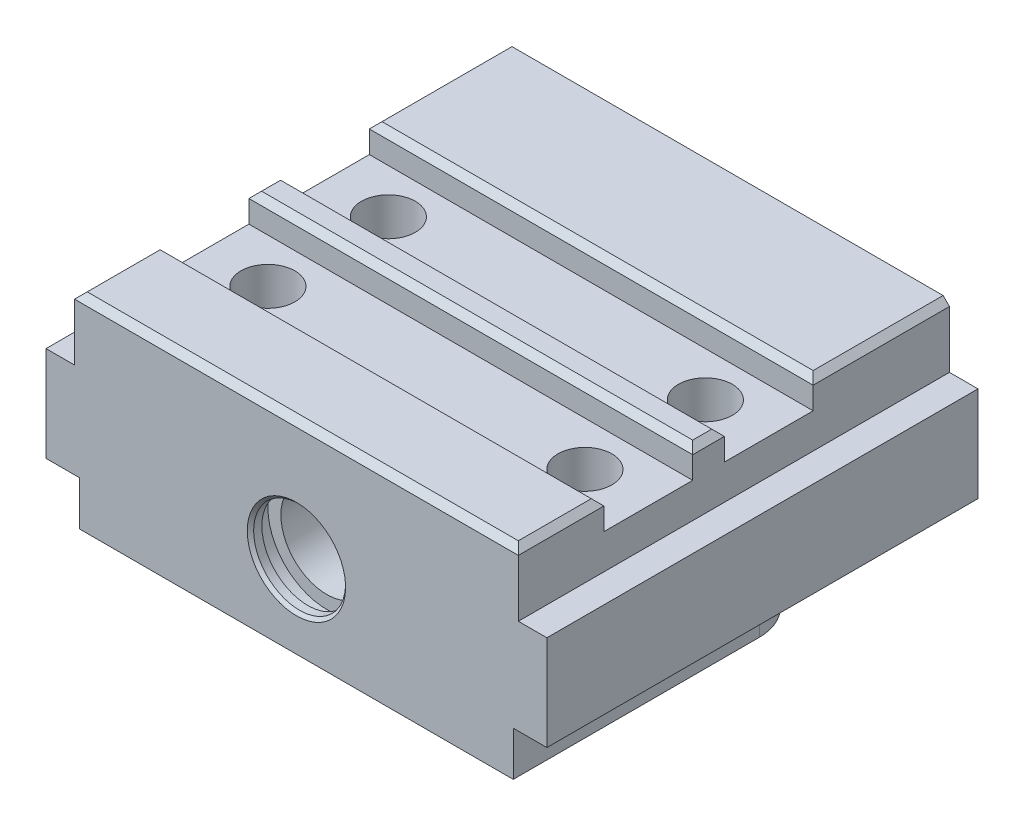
ISO-10303-21;
HEADER;
FILE_DESCRIPTION(('STEP AP214'),'2;1');
FILE_NAME('part.step','',(''),(''),'','','');
FILE_SCHEMA(('AUTOMOTIVE_DESIGN { 1 0 10303 214 1 1 1 1 }'));
ENDSEC;
DATA;
#1=APPLICATION_CONTEXT('core data for automotive mechanical design processes');
#2=APPLICATION_PROTOCOL_DEFINITION('international standard','automotive_design',2000,#1);
#3=PRODUCT_CONTEXT('',#1,'mechanical');
#4=PRODUCT('Part','Part','',(#3));
#5=PRODUCT_RELATED_PRODUCT_CATEGORY('part','',(#4));
#6=PRODUCT_DEFINITION_FORMATION('','',#4);
#7=PRODUCT_DEFINITION_CONTEXT('part definition',#1,'design');
#8=PRODUCT_DEFINITION('design','',#6,#7);
#9=PRODUCT_DEFINITION_SHAPE('','',#8);
#10=(LENGTH_UNIT() NAMED_UNIT(*) SI_UNIT(.MILLI.,.METRE.));
#11=(NAMED_UNIT(*) PLANE_ANGLE_UNIT() SI_UNIT($,.RADIAN.));
#12=(NAMED_UNIT(*) SI_UNIT($,.STERADIAN.) SOLID_ANGLE_UNIT());
#13=UNCERTAINTY_MEASURE_WITH_UNIT(LENGTH_MEASURE(1.E-05),#10,'distance_accuracy_value','');
#14=(GEOMETRIC_REPRESENTATION_CONTEXT(3) GLOBAL_UNCERTAINTY_ASSIGNED_CONTEXT((#13)) GLOBAL_UNIT_ASSIGNED_CONTEXT((#10,
#11,#12)) REPRESENTATION_CONTEXT('',''));
#15=CARTESIAN_POINT('',(0.,0.,0.));
#16=DIRECTION('',(0.,0.,1.));
#17=DIRECTION('',(1.,0.,0.));
#18=AXIS2_PLACEMENT_3D('',#15,#16,#17);
#19=CARTESIAN_POINT('',(-26.2,7.,-12.8));
#20=DIRECTION('',(0.,0.,-1.));
#21=DIRECTION('',(-1.,0.,0.));
#22=AXIS2_PLACEMENT_3D('',#19,#20,#21);
#23=PLANE('',#22);
#24=DIRECTION('',(0.,-1.,0.));
#25=VECTOR('',#24,1.);
#26=CARTESIAN_POINT('',(-10.0521286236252,26.,-12.8));
#27=LINE('',#26,#25);
#28=CARTESIAN_POINT('',(-10.0521286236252,10.767483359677,-12.8));
#29=VERTEX_POINT('',#28);
#30=CARTESIAN_POINT('',(-10.0521286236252,0.,-12.8));
#31=VERTEX_POINT('',#30);
#32=EDGE_CURVE('E277',#29,#31,#27,.T.);
#33=ORIENTED_EDGE('',*,*,#32,.F.);
#34=CARTESIAN_POINT('',(0.,13.,-12.8));
#35=DIRECTION('',(0.,0.,-1.));
#36=DIRECTION('',(-1.,0.,0.));
#37=AXIS2_PLACEMENT_3D('',#34,#35,#36);
#38=CIRCLE('',#37,10.2970588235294);
#39=CARTESIAN_POINT('',(10.0521286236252,10.7674833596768,-12.8));
#40=VERTEX_POINT('',#39);
#41=EDGE_CURVE('E266',#29,#40,#38,.F.);
#42=ORIENTED_EDGE('',*,*,#41,.T.);
#43=DIRECTION('',(0.,-1.,0.));
#44=VECTOR('',#43,1.);
#45=CARTESIAN_POINT('',(10.0521286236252,26.,-12.8));
#46=LINE('',#45,#44);
#47=CARTESIAN_POINT('',(10.0521286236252,0.,-12.8));
#48=VERTEX_POINT('',#47);
#49=EDGE_CURVE('E275',#40,#48,#46,.T.);
#50=ORIENTED_EDGE('',*,*,#49,.T.);
#51=DIRECTION('',(1.,0.,0.));
#52=VECTOR('',#51,1.);
#53=CARTESIAN_POINT('',(-26.2,0.,-12.8));
#54=LINE('',#53,#52);
#55=EDGE_CURVE('E404',#31,#48,#54,.T.);
#56=ORIENTED_EDGE('',*,*,#55,.F.);
#57=EDGE_LOOP('',(#33,#42,#50,#56));
#58=FACE_BOUND('',#57,.T.);
#59=ADVANCED_FACE('F16',(#58),#23,.T.);
#60=CARTESIAN_POINT('',(-12.4,26.,-16.1));
#61=DIRECTION('',(0.,-1.,0.));
#62=DIRECTION('',(0.,0.,-1.));
#63=AXIS2_PLACEMENT_3D('',#60,#61,#62);
#64=CYLINDRICAL_SURFACE('',#63,4.05);
#65=CARTESIAN_POINT('',(-10.0521286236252,26.,-12.8));
#66=VERTEX_POINT('',#65);
#67=CARTESIAN_POINT('',(-10.0521286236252,15.2325166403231,-12.8));
#68=VERTEX_POINT('',#67);
#69=EDGE_CURVE('E291',#66,#68,#27,.T.);
#70=ORIENTED_EDGE('',*,*,#69,.T.);
#71=CARTESIAN_POINT('',(-10.0519286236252,15.2336562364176,-12.8001423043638));
#72=CARTESIAN_POINT('',(-10.0777059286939,15.0868722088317,-12.7818191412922));
#73=CARTESIAN_POINT('',(-10.1011031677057,14.9394109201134,-12.7656064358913));
#74=CARTESIAN_POINT('',(-10.1429419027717,14.643408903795,-12.7371348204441));
#75=CARTESIAN_POINT('',(-10.1613834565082,14.4948681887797,-12.7248758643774));
#76=CARTESIAN_POINT('',(-10.1931244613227,14.1968978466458,-12.7040385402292));
#77=CARTESIAN_POINT('',(-10.2064211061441,14.0474677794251,-12.6954621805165));
#78=CARTESIAN_POINT('',(-10.2277359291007,13.7480819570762,-12.6818246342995));
#79=CARTESIAN_POINT('',(-10.2357541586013,13.5981262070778,-12.6767634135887));
#80=CARTESIAN_POINT('',(-10.2515753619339,13.1531063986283,-12.6667819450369));
#81=CARTESIAN_POINT('',(-10.251708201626,12.8576152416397,-12.6667081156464));
#82=CARTESIAN_POINT('',(-10.2312274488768,12.2678089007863,-12.6796099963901));
#83=CARTESIAN_POINT('',(-10.2106273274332,11.9734930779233,-12.6925772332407));
#84=CARTESIAN_POINT('',(-10.1720752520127,11.6042443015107,-12.7178512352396));
#85=CARTESIAN_POINT('',(-10.1634008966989,11.5277987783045,-12.7235747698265));
#86=CARTESIAN_POINT('',(-10.1447163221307,11.375162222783,-12.7360254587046));
#87=CARTESIAN_POINT('',(-10.1347063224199,11.2989711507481,-12.7427524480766));
#88=CARTESIAN_POINT('',(-10.1133254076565,11.1465206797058,-12.7572785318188));
#89=CARTESIAN_POINT('',(-10.1019484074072,11.0702625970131,-12.7650824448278));
#90=CARTESIAN_POINT('',(-10.0779006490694,10.9180573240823,-12.7817825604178));
#91=CARTESIAN_POINT('',(-10.0652296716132,10.8421101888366,-12.7906789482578));
#92=CARTESIAN_POINT('',(-10.0519286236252,10.7663437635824,-12.8001423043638));
#93=B_SPLINE_CURVE_WITH_KNOTS('',3,(#71,#72,#73,#74,#75,#76,#77,#78,#79,#80,#81,#82,#83,#84,#85,
#86,#87,#88,#89,#90,#91,#92),.UNSPECIFIED.,.F.,.F.,(4,2,2,2,2,2,2,2,2,2,4),(0.,0.45041584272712,
0.900826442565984,1.35148237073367,1.80213391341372,2.68753885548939,3.57236888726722,
3.80380514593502,4.03520340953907,4.26767281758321,4.50018170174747),.UNSPECIFIED.);
#94=EDGE_CURVE('E278',#68,#29,#93,.T.);
#95=ORIENTED_EDGE('',*,*,#94,.T.);
#96=ORIENTED_EDGE('',*,*,#32,.T.);
#97=CARTESIAN_POINT('',(-12.4,0.,-16.1));
#98=DIRECTION('',(0.,1.,0.));
#99=DIRECTION('',(1.,0.,0.));
#100=AXIS2_PLACEMENT_3D('',#97,#98,#99);
#101=CIRCLE('',#100,4.05);
#102=CARTESIAN_POINT('',(-14.7478713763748,0.,-12.8));
#103=VERTEX_POINT('',#102);
#104=EDGE_CURVE('E615',#103,#31,#101,.T.);
#105=ORIENTED_EDGE('',*,*,#104,.F.);
#106=DIRECTION('',(0.,-1.,0.));
#107=VECTOR('',#106,1.);
#108=CARTESIAN_POINT('',(-14.7478713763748,26.,-12.8));
#109=LINE('',#108,#107);
#110=CARTESIAN_POINT('',(-14.7478713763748,7.,-12.8));
#111=VERTEX_POINT('',#110);
#112=EDGE_CURVE('E300',#111,#103,#109,.T.);
#113=ORIENTED_EDGE('',*,*,#112,.F.);
#114=CARTESIAN_POINT('',(-12.4,7.,-16.1));
#115=DIRECTION('',(0.,1.,0.));
#116=DIRECTION('',(0.,0.,1.));
#117=AXIS2_PLACEMENT_3D('',#114,#115,#116);
#118=CIRCLE('',#117,4.05);
#119=CARTESIAN_POINT('',(-15.,7.,-19.2052375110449));
#120=VERTEX_POINT('',#119);
#121=EDGE_CURVE('E523',#111,#120,#118,.F.);
#122=ORIENTED_EDGE('',*,*,#121,.T.);
#123=DIRECTION('',(0.,-1.,0.));
#124=VECTOR('',#123,1.);
#125=CARTESIAN_POINT('',(-15.,26.,-19.2052375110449));
#126=LINE('',#125,#124);
#127=CARTESIAN_POINT('',(-15.,26.,-19.2052375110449));
#128=VERTEX_POINT('',#127);
#129=EDGE_CURVE('E294',#128,#120,#126,.T.);
#130=ORIENTED_EDGE('',*,*,#129,.F.);
#131=CARTESIAN_POINT('',(-12.4,26.,-16.1));
#132=DIRECTION('',(0.,1.,0.));
#133=DIRECTION('',(1.,0.,0.));
#134=AXIS2_PLACEMENT_3D('',#131,#132,#133);
#135=CIRCLE('',#134,4.05);
#136=EDGE_CURVE('E617',#128,#66,#135,.T.);
#137=ORIENTED_EDGE('',*,*,#136,.T.);
#138=EDGE_LOOP('',(#70,#95,#96,#105,#113,#122,#130,#137));
#139=FACE_BOUND('',#138,.T.);
#140=ADVANCED_FACE('F659',(#139),#64,.F.);
#141=CARTESIAN_POINT('',(12.4,26.,-16.1));
#142=DIRECTION('',(0.,-1.,0.));
#143=DIRECTION('',(0.,0.,-1.));
#144=AXIS2_PLACEMENT_3D('',#141,#142,#143);
#145=CYLINDRICAL_SURFACE('',#144,4.05);
#146=ORIENTED_EDGE('',*,*,#49,.F.);
#147=CARTESIAN_POINT('',(10.0519286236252,10.7663437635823,-12.8001423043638));
#148=CARTESIAN_POINT('',(10.0777059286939,10.9131277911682,-12.7818191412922));
#149=CARTESIAN_POINT('',(10.1011031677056,11.0605890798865,-12.7656064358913));
#150=CARTESIAN_POINT('',(10.1429419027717,11.3565910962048,-12.7371348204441));
#151=CARTESIAN_POINT('',(10.1613834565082,11.5051318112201,-12.7248758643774));
#152=CARTESIAN_POINT('',(10.1931244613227,11.8031021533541,-12.7040385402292));
#153=CARTESIAN_POINT('',(10.2064211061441,11.9525322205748,-12.6954621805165));
#154=CARTESIAN_POINT('',(10.2277359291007,12.2519180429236,-12.6818246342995));
#155=CARTESIAN_POINT('',(10.2357541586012,12.401873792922,-12.6767634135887));
#156=CARTESIAN_POINT('',(10.2515753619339,12.8468936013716,-12.6667819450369));
#157=CARTESIAN_POINT('',(10.251708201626,13.1423847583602,-12.6667081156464));
#158=CARTESIAN_POINT('',(10.2312274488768,13.7321910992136,-12.6796099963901));
#159=CARTESIAN_POINT('',(10.2106273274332,14.0265069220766,-12.6925772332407));
#160=CARTESIAN_POINT('',(10.1720752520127,14.3957556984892,-12.7178512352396));
#161=CARTESIAN_POINT('',(10.1634008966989,14.4722012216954,-12.7235747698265));
#162=CARTESIAN_POINT('',(10.1447163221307,14.6248377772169,-12.7360254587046));
#163=CARTESIAN_POINT('',(10.1347063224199,14.7010288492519,-12.7427524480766));
#164=CARTESIAN_POINT('',(10.1133254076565,14.8534793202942,-12.7572785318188));
#165=CARTESIAN_POINT('',(10.1019484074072,14.929737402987,-12.7650824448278));
#166=CARTESIAN_POINT('',(10.0779006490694,15.0819426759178,-12.7817825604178));
#167=CARTESIAN_POINT('',(10.0652296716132,15.1578898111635,-12.7906789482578));
#168=CARTESIAN_POINT('',(10.0519286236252,15.2336562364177,-12.8001423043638));
#169=B_SPLINE_CURVE_WITH_KNOTS('',3,(#147,#148,#149,#150,#151,#152,#153,#154,#155,#156,#157,
#158,#159,#160,#161,#162,#163,#164,#165,#166,#167,#168),.UNSPECIFIED.,.F.,.F.,(4,2,2,2,2,2,2,2,
2,2,4),(0.,0.450415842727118,0.900826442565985,1.35148237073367,1.80213391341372,
2.68753885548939,3.57236888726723,3.8038051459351,4.03520340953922,4.26767281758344,
4.50018170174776),.UNSPECIFIED.);
#170=CARTESIAN_POINT('',(10.0521286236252,15.2325166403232,-12.8));
#171=VERTEX_POINT('',#170);
#172=EDGE_CURVE('E11',#40,#171,#169,.T.);
#173=ORIENTED_EDGE('',*,*,#172,.T.);
#174=CARTESIAN_POINT('',(10.0521286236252,26.,-12.8));
#175=VERTEX_POINT('',#174);
#176=EDGE_CURVE('E284',#175,#171,#46,.T.);
#177=ORIENTED_EDGE('',*,*,#176,.F.);
#178=CARTESIAN_POINT('',(12.4,26.,-16.1));
#179=DIRECTION('',(0.,1.,0.));
#180=DIRECTION('',(1.,0.,0.));
#181=AXIS2_PLACEMENT_3D('',#178,#179,#180);
#182=CIRCLE('',#181,4.05);
#183=CARTESIAN_POINT('',(15.,26.,-19.2052375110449));
#184=VERTEX_POINT('',#183);
#185=EDGE_CURVE('E625',#175,#184,#182,.T.);
#186=ORIENTED_EDGE('',*,*,#185,.T.);
#187=DIRECTION('',(0.,-1.,0.));
#188=VECTOR('',#187,1.);
#189=CARTESIAN_POINT('',(15.,26.,-19.2052375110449));
#190=LINE('',#189,#188);
#191=CARTESIAN_POINT('',(15.,7.,-19.2052375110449));
#192=VERTEX_POINT('',#191);
#193=EDGE_CURVE('E285',#184,#192,#190,.T.);
#194=ORIENTED_EDGE('',*,*,#193,.T.);
#195=CARTESIAN_POINT('',(12.4,7.,-16.1));
#196=DIRECTION('',(0.,1.,0.));
#197=DIRECTION('',(0.,0.,1.));
#198=AXIS2_PLACEMENT_3D('',#195,#196,#197);
#199=CIRCLE('',#198,4.05);
#200=CARTESIAN_POINT('',(14.7478713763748,7.,-12.8));
#201=VERTEX_POINT('',#200);
#202=EDGE_CURVE('E521',#192,#201,#199,.F.);
#203=ORIENTED_EDGE('',*,*,#202,.T.);
#204=DIRECTION('',(0.,-1.,0.));
#205=VECTOR('',#204,1.);
#206=CARTESIAN_POINT('',(14.7478713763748,26.,-12.8));
#207=LINE('',#206,#205);
#208=CARTESIAN_POINT('',(14.7478713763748,0.,-12.8));
#209=VERTEX_POINT('',#208);
#210=EDGE_CURVE('E297',#209,#201,#207,.F.);
#211=ORIENTED_EDGE('',*,*,#210,.F.);
#212=CARTESIAN_POINT('',(12.4,0.,-16.1));
#213=DIRECTION('',(0.,1.,0.));
#214=DIRECTION('',(1.,0.,0.));
#215=AXIS2_PLACEMENT_3D('',#212,#213,#214);
#216=CIRCLE('',#215,4.05);
#217=EDGE_CURVE('E282',#48,#209,#216,.T.);
#218=ORIENTED_EDGE('',*,*,#217,.F.);
#219=EDGE_LOOP('',(#146,#173,#177,#186,#194,#203,#211,#218));
#220=FACE_BOUND('',#219,.T.);
#221=ADVANCED_FACE('F280',(#220),#145,.F.);
#222=CARTESIAN_POINT('',(0.,0.,-34.));
#223=DIRECTION('',(0.,0.,1.));
#224=DIRECTION('',(1.,0.,0.));
#225=AXIS2_PLACEMENT_3D('',#222,#223,#224);
#226=PLANE('',#225);
#227=DIRECTION('',(0.,-1.,0.));
#228=VECTOR('',#227,1.);
#229=CARTESIAN_POINT('',(-15.,26.,-34.));
#230=LINE('',#229,#228);
#231=CARTESIAN_POINT('',(-15.,26.,-34.));
#232=VERTEX_POINT('',#231);
#233=CARTESIAN_POINT('',(-15.,7.,-34.));
#234=VERTEX_POINT('',#233);
#235=EDGE_CURVE('E529',#232,#234,#230,.T.);
#236=ORIENTED_EDGE('',*,*,#235,.T.);
#237=DIRECTION('',(-1.,0.,0.));
#238=VECTOR('',#237,1.);
#239=CARTESIAN_POINT('',(39.5,7.,-34.));
#240=LINE('',#239,#238);
#241=CARTESIAN_POINT('',(-39.5,7.,-34.));
#242=VERTEX_POINT('',#241);
#243=EDGE_CURVE('E367',#234,#242,#240,.T.);
#244=ORIENTED_EDGE('',*,*,#243,.T.);
#245=DIRECTION('',(0.,-1.,0.));
#246=VECTOR('',#245,1.);
#247=CARTESIAN_POINT('',(-39.5,22.,-34.));
#248=LINE('',#247,#246);
#249=CARTESIAN_POINT('',(-39.5,22.,-34.));
#250=VERTEX_POINT('',#249);
#251=EDGE_CURVE('E446',#250,#242,#248,.T.);
#252=ORIENTED_EDGE('',*,*,#251,.F.);
#253=DIRECTION('',(-1.,0.,0.));
#254=VECTOR('',#253,1.);
#255=CARTESIAN_POINT('',(-35.,22.,-34.));
#256=LINE('',#255,#254);
#257=CARTESIAN_POINT('',(-35.,22.,-34.));
#258=VERTEX_POINT('',#257);
#259=EDGE_CURVE('E423',#258,#250,#256,.T.);
#260=ORIENTED_EDGE('',*,*,#259,.F.);
#261=DIRECTION('',(0.,-1.,0.));
#262=VECTOR('',#261,1.);
#263=CARTESIAN_POINT('',(-35.,31.,-34.));
#264=LINE('',#263,#262);
#265=CARTESIAN_POINT('',(-35.,31.,-34.));
#266=VERTEX_POINT('',#265);
#267=EDGE_CURVE('E428',#266,#258,#264,.T.);
#268=ORIENTED_EDGE('',*,*,#267,.F.);
#269=DIRECTION('',(-0.707106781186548,-0.707106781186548,0.));
#270=VECTOR('',#269,1.);
#271=CARTESIAN_POINT('',(-34.,32.,-34.));
#272=LINE('',#271,#270);
#273=CARTESIAN_POINT('',(-34.,32.,-34.));
#274=VERTEX_POINT('',#273);
#275=EDGE_CURVE('E462',#274,#266,#272,.T.);
#276=ORIENTED_EDGE('',*,*,#275,.F.);
#277=DIRECTION('',(-1.,0.,0.));
#278=VECTOR('',#277,1.);
#279=CARTESIAN_POINT('',(34.,32.,-34.));
#280=LINE('',#279,#278);
#281=CARTESIAN_POINT('',(34.,32.,-34.));
#282=VERTEX_POINT('',#281);
#283=EDGE_CURVE('E459',#282,#274,#280,.T.);
#284=ORIENTED_EDGE('',*,*,#283,.F.);
#285=DIRECTION('',(-0.707106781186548,0.707106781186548,0.));
#286=VECTOR('',#285,1.);
#287=CARTESIAN_POINT('',(35.,31.,-34.));
#288=LINE('',#287,#286);
#289=CARTESIAN_POINT('',(35.,31.,-34.));
#290=VERTEX_POINT('',#289);
#291=EDGE_CURVE('E456',#290,#282,#288,.T.);
#292=ORIENTED_EDGE('',*,*,#291,.F.);
#293=DIRECTION('',(0.,1.,0.));
#294=VECTOR('',#293,1.);
#295=CARTESIAN_POINT('',(35.,22.,-34.));
#296=LINE('',#295,#294);
#297=CARTESIAN_POINT('',(35.,22.,-34.));
#298=VERTEX_POINT('',#297);
#299=EDGE_CURVE('E453',#298,#290,#296,.T.);
#300=ORIENTED_EDGE('',*,*,#299,.F.);
#301=DIRECTION('',(-1.,0.,0.));
#302=VECTOR('',#301,1.);
#303=CARTESIAN_POINT('',(39.5,22.,-34.));
#304=LINE('',#303,#302);
#305=CARTESIAN_POINT('',(39.5,22.,-34.));
#306=VERTEX_POINT('',#305);
#307=EDGE_CURVE('E451',#306,#298,#304,.T.);
#308=ORIENTED_EDGE('',*,*,#307,.F.);
#309=DIRECTION('',(0.,1.,0.));
#310=VECTOR('',#309,1.);
#311=CARTESIAN_POINT('',(39.5,0.,-34.));
#312=LINE('',#311,#310);
#313=CARTESIAN_POINT('',(39.5,7.,-34.));
#314=VERTEX_POINT('',#313);
#315=EDGE_CURVE('E449',#314,#306,#312,.T.);
#316=ORIENTED_EDGE('',*,*,#315,.F.);
#317=CARTESIAN_POINT('',(15.,7.,-34.));
#318=VERTEX_POINT('',#317);
#319=EDGE_CURVE('E363',#314,#318,#240,.T.);
#320=ORIENTED_EDGE('',*,*,#319,.T.);
#321=DIRECTION('',(0.,-1.,0.));
#322=VECTOR('',#321,1.);
#323=CARTESIAN_POINT('',(15.,26.,-34.));
#324=LINE('',#323,#322);
#325=CARTESIAN_POINT('',(15.,26.,-34.));
#326=VERTEX_POINT('',#325);
#327=EDGE_CURVE('E44',#326,#318,#324,.T.);
#328=ORIENTED_EDGE('',*,*,#327,.F.);
#329=DIRECTION('',(-1.,0.,0.));
#330=VECTOR('',#329,1.);
#331=CARTESIAN_POINT('',(15.,26.,-34.));
#332=LINE('',#331,#330);
#333=EDGE_CURVE('E540',#326,#232,#332,.T.);
#334=ORIENTED_EDGE('',*,*,#333,.T.);
#335=EDGE_LOOP('',(#236,#244,#252,#260,#268,#276,#284,#292,#300,#308,#316,#320,#328,#334));
#336=FACE_BOUND('',#335,.T.);
#337=ADVANCED_FACE('F537',(#336),#226,.F.);
#338=ORIENTED_EDGE('',*,*,#176,.T.);
#339=EDGE_CURVE('E37',#171,#68,#38,.F.);
#340=ORIENTED_EDGE('',*,*,#339,.T.);
#341=ORIENTED_EDGE('',*,*,#69,.F.);
#342=DIRECTION('',(1.,0.,0.));
#343=VECTOR('',#342,1.);
#344=CARTESIAN_POINT('',(-10.0521286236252,26.,-12.8));
#345=LINE('',#344,#343);
#346=EDGE_CURVE('E627',#66,#175,#345,.T.);
#347=ORIENTED_EDGE('',*,*,#346,.T.);
#348=EDGE_LOOP('',(#338,#340,#341,#347));
#349=FACE_BOUND('',#348,.T.);
#350=ADVANCED_FACE('F736',(#349),#23,.T.);
#351=DIRECTION('',(1.,0.,0.));
#352=VECTOR('',#351,1.);
#353=CARTESIAN_POINT('',(-26.2,7.,-12.8));
#354=LINE('',#353,#352);
#355=CARTESIAN_POINT('',(-26.2,7.,-12.8));
#356=VERTEX_POINT('',#355);
#357=EDGE_CURVE('E379',#356,#111,#354,.T.);
#358=ORIENTED_EDGE('',*,*,#357,.T.);
#359=ORIENTED_EDGE('',*,*,#112,.T.);
#360=CARTESIAN_POINT('',(-26.2,0.,-12.8));
#361=VERTEX_POINT('',#360);
#362=EDGE_CURVE('E400',#361,#103,#54,.T.);
#363=ORIENTED_EDGE('',*,*,#362,.F.);
#364=DIRECTION('',(0.,-1.,0.));
#365=VECTOR('',#364,1.);
#366=CARTESIAN_POINT('',(-26.2,7.,-12.8));
#367=LINE('',#366,#365);
#368=EDGE_CURVE('E416',#356,#361,#367,.T.);
#369=ORIENTED_EDGE('',*,*,#368,.F.);
#370=EDGE_LOOP('',(#358,#359,#363,#369));
#371=FACE_BOUND('',#370,.T.);
#372=ADVANCED_FACE('F741',(#371),#23,.T.);
#373=CARTESIAN_POINT('',(26.2,0.,-12.8));
#374=VERTEX_POINT('',#373);
#375=EDGE_CURVE('E399',#209,#374,#54,.T.);
#376=ORIENTED_EDGE('',*,*,#375,.F.);
#377=ORIENTED_EDGE('',*,*,#210,.T.);
#378=CARTESIAN_POINT('',(26.2,7.,-12.8));
#379=VERTEX_POINT('',#378);
#380=EDGE_CURVE('E378',#201,#379,#354,.T.);
#381=ORIENTED_EDGE('',*,*,#380,.T.);
#382=DIRECTION('',(0.,-1.,0.));
#383=VECTOR('',#382,1.);
#384=CARTESIAN_POINT('',(26.2,7.,-12.8));
#385=LINE('',#384,#383);
#386=EDGE_CURVE('E413',#379,#374,#385,.T.);
#387=ORIENTED_EDGE('',*,*,#386,.T.);
#388=EDGE_LOOP('',(#376,#377,#381,#387));
#389=FACE_BOUND('',#388,.T.);
#390=ADVANCED_FACE('F613',(#389),#23,.T.);
#391=CARTESIAN_POINT('',(-26.2,7.,-4.8));
#392=DIRECTION('',(0.,1.,0.));
#393=DIRECTION('',(0.,0.,1.));
#394=AXIS2_PLACEMENT_3D('',#391,#392,#393);
#395=PLANE('',#394);
#396=DIRECTION('',(0.,0.,-1.));
#397=VECTOR('',#396,1.);
#398=CARTESIAN_POINT('',(-15.,7.,-4.8));
#399=LINE('',#398,#397);
#400=EDGE_CURVE('E30',#120,#234,#399,.T.);
#401=ORIENTED_EDGE('',*,*,#400,.F.);
#402=ORIENTED_EDGE('',*,*,#121,.F.);
#403=ORIENTED_EDGE('',*,*,#357,.F.);
#404=CARTESIAN_POINT('',(-26.2,7.,-4.8));
#405=DIRECTION('',(0.,1.,0.));
#406=DIRECTION('',(1.,0.,0.));
#407=AXIS2_PLACEMENT_3D('',#404,#405,#406);
#408=CIRCLE('',#407,8.);
#409=CARTESIAN_POINT('',(-34.2,7.,-4.8));
#410=VERTEX_POINT('',#409);
#411=EDGE_CURVE('E375',#356,#410,#408,.T.);
#412=ORIENTED_EDGE('',*,*,#411,.T.);
#413=DIRECTION('',(0.,0.,-1.));
#414=VECTOR('',#413,1.);
#415=CARTESIAN_POINT('',(-34.2,7.,34.));
#416=LINE('',#415,#414);
#417=CARTESIAN_POINT('',(-34.2,7.,34.));
#418=VERTEX_POINT('',#417);
#419=EDGE_CURVE('E373',#418,#410,#416,.T.);
#420=ORIENTED_EDGE('',*,*,#419,.F.);
#421=DIRECTION('',(1.,0.,0.));
#422=VECTOR('',#421,1.);
#423=CARTESIAN_POINT('',(-39.5,7.,34.));
#424=LINE('',#423,#422);
#425=CARTESIAN_POINT('',(-39.5,7.,34.));
#426=VERTEX_POINT('',#425);
#427=EDGE_CURVE('E370',#426,#418,#424,.T.);
#428=ORIENTED_EDGE('',*,*,#427,.F.);
#429=DIRECTION('',(0.,0.,1.));
#430=VECTOR('',#429,1.);
#431=CARTESIAN_POINT('',(-39.5,7.,-34.));
#432=LINE('',#431,#430);
#433=EDGE_CURVE('E366',#242,#426,#432,.T.);
#434=ORIENTED_EDGE('',*,*,#433,.F.);
#435=ORIENTED_EDGE('',*,*,#243,.F.);
#436=EDGE_LOOP('',(#401,#402,#403,#412,#420,#428,#434,#435));
#437=FACE_BOUND('',#436,.T.);
#438=ADVANCED_FACE('F542',(#437),#395,.F.);
#439=ORIENTED_EDGE('',*,*,#202,.F.);
#440=DIRECTION('',(0.,0.,1.));
#441=VECTOR('',#440,1.);
#442=CARTESIAN_POINT('',(15.,7.,-4.8));
#443=LINE('',#442,#441);
#444=EDGE_CURVE('E519',#318,#192,#443,.T.);
#445=ORIENTED_EDGE('',*,*,#444,.F.);
#446=ORIENTED_EDGE('',*,*,#319,.F.);
#447=DIRECTION('',(0.,0.,-1.));
#448=VECTOR('',#447,1.);
#449=CARTESIAN_POINT('',(39.5,7.,34.));
#450=LINE('',#449,#448);
#451=CARTESIAN_POINT('',(39.5,7.,34.));
#452=VERTEX_POINT('',#451);
#453=EDGE_CURVE('E390',#452,#314,#450,.T.);
#454=ORIENTED_EDGE('',*,*,#453,.F.);
#455=DIRECTION('',(1.,0.,0.));
#456=VECTOR('',#455,1.);
#457=CARTESIAN_POINT('',(34.2,7.,34.));
#458=LINE('',#457,#456);
#459=CARTESIAN_POINT('',(34.2,7.,34.));
#460=VERTEX_POINT('',#459);
#461=EDGE_CURVE('E387',#460,#452,#458,.T.);
#462=ORIENTED_EDGE('',*,*,#461,.F.);
#463=DIRECTION('',(0.,0.,1.));
#464=VECTOR('',#463,1.);
#465=CARTESIAN_POINT('',(34.2,7.,-4.8));
#466=LINE('',#465,#464);
#467=CARTESIAN_POINT('',(34.2,7.,-4.8));
#468=VERTEX_POINT('',#467);
#469=EDGE_CURVE('E385',#468,#460,#466,.T.);
#470=ORIENTED_EDGE('',*,*,#469,.F.);
#471=CARTESIAN_POINT('',(26.2,7.,-4.8));
#472=DIRECTION('',(0.,1.,0.));
#473=DIRECTION('',(1.,0.,0.));
#474=AXIS2_PLACEMENT_3D('',#471,#472,#473);
#475=CIRCLE('',#474,8.);
#476=EDGE_CURVE('E382',#468,#379,#475,.T.);
#477=ORIENTED_EDGE('',*,*,#476,.T.);
#478=ORIENTED_EDGE('',*,*,#380,.F.);
#479=EDGE_LOOP('',(#439,#445,#446,#454,#462,#470,#477,#478));
#480=FACE_BOUND('',#479,.T.);
#481=ADVANCED_FACE('F593',(#480),#395,.F.);
#482=CARTESIAN_POINT('',(0.,0.,34.));
#483=DIRECTION('',(0.,0.,1.));
#484=DIRECTION('',(1.,0.,0.));
#485=AXIS2_PLACEMENT_3D('',#482,#483,#484);
#486=PLANE('',#485);
#487=CARTESIAN_POINT('',(0.,13.,34.));
#488=DIRECTION('',(0.,0.,-1.));
#489=DIRECTION('',(-1.,0.,0.));
#490=AXIS2_PLACEMENT_3D('',#487,#488,#489);
#491=CIRCLE('',#490,7.75);
#492=CARTESIAN_POINT('',(-7.75,13.,34.));
#493=VERTEX_POINT('',#492);
#494=EDGE_CURVE('E1253',#493,#493,#491,.T.);
#495=ORIENTED_EDGE('',*,*,#494,.T.);
#496=EDGE_LOOP('',(#495));
#497=FACE_BOUND('',#496,.T.);
#498=DIRECTION('',(0.,1.,0.));
#499=VECTOR('',#498,1.);
#500=CARTESIAN_POINT('',(35.,22.,34.));
#501=LINE('',#500,#499);
#502=CARTESIAN_POINT('',(35.,22.,34.));
#503=VERTEX_POINT('',#502);
#504=CARTESIAN_POINT('',(35.,31.,34.));
#505=VERTEX_POINT('',#504);
#506=EDGE_CURVE('E438',#503,#505,#501,.T.);
#507=ORIENTED_EDGE('',*,*,#506,.T.);
#508=DIRECTION('',(-1.,0.,0.));
#509=VECTOR('',#508,1.);
#510=CARTESIAN_POINT('',(40.,31.,34.));
#511=LINE('',#510,#509);
#512=CARTESIAN_POINT('',(-35.,31.,34.));
#513=VERTEX_POINT('',#512);
#514=EDGE_CURVE('E337',#505,#513,#511,.T.);
#515=ORIENTED_EDGE('',*,*,#514,.T.);
#516=DIRECTION('',(0.,-1.,0.));
#517=VECTOR('',#516,1.);
#518=CARTESIAN_POINT('',(-35.,31.,34.));
#519=LINE('',#518,#517);
#520=CARTESIAN_POINT('',(-35.,22.,34.));
#521=VERTEX_POINT('',#520);
#522=EDGE_CURVE('E441',#513,#521,#519,.T.);
#523=ORIENTED_EDGE('',*,*,#522,.T.);
#524=DIRECTION('',(-1.,0.,0.));
#525=VECTOR('',#524,1.);
#526=CARTESIAN_POINT('',(-35.,22.,34.));
#527=LINE('',#526,#525);
#528=CARTESIAN_POINT('',(-39.5,22.,34.));
#529=VERTEX_POINT('',#528);
#530=EDGE_CURVE('E424',#521,#529,#527,.T.);
#531=ORIENTED_EDGE('',*,*,#530,.T.);
#532=DIRECTION('',(0.,-1.,0.));
#533=VECTOR('',#532,1.);
#534=CARTESIAN_POINT('',(-39.5,22.,34.));
#535=LINE('',#534,#533);
#536=EDGE_CURVE('E427',#529,#426,#535,.T.);
#537=ORIENTED_EDGE('',*,*,#536,.T.);
#538=ORIENTED_EDGE('',*,*,#427,.T.);
#539=DIRECTION('',(0.,-1.,0.));
#540=VECTOR('',#539,1.);
#541=CARTESIAN_POINT('',(-34.2,7.,34.));
#542=LINE('',#541,#540);
#543=CARTESIAN_POINT('',(-34.2,0.,34.));
#544=VERTEX_POINT('',#543);
#545=EDGE_CURVE('E420',#418,#544,#542,.T.);
#546=ORIENTED_EDGE('',*,*,#545,.T.);
#547=DIRECTION('',(1.,0.,0.));
#548=VECTOR('',#547,1.);
#549=CARTESIAN_POINT('',(-39.5,0.,34.));
#550=LINE('',#549,#548);
#551=CARTESIAN_POINT('',(34.2,0.,34.));
#552=VERTEX_POINT('',#551);
#553=EDGE_CURVE('E431',#544,#552,#550,.T.);
#554=ORIENTED_EDGE('',*,*,#553,.T.);
#555=DIRECTION('',(0.,-1.,0.));
#556=VECTOR('',#555,1.);
#557=CARTESIAN_POINT('',(34.2,7.,34.));
#558=LINE('',#557,#556);
#559=EDGE_CURVE('E393',#460,#552,#558,.T.);
#560=ORIENTED_EDGE('',*,*,#559,.F.);
#561=ORIENTED_EDGE('',*,*,#461,.T.);
#562=DIRECTION('',(0.,1.,0.));
#563=VECTOR('',#562,1.);
#564=CARTESIAN_POINT('',(39.5,0.,34.));
#565=LINE('',#564,#563);
#566=CARTESIAN_POINT('',(39.5,22.,34.));
#567=VERTEX_POINT('',#566);
#568=EDGE_CURVE('E434',#452,#567,#565,.T.);
#569=ORIENTED_EDGE('',*,*,#568,.T.);
#570=DIRECTION('',(-1.,0.,0.));
#571=VECTOR('',#570,1.);
#572=CARTESIAN_POINT('',(39.5,22.,34.));
#573=LINE('',#572,#571);
#574=EDGE_CURVE('E436',#567,#503,#573,.T.);
#575=ORIENTED_EDGE('',*,*,#574,.T.);
#576=EDGE_LOOP('',(#507,#515,#523,#531,#537,#538,#546,#554,#560,#561,#569,#575));
#577=FACE_BOUND('',#576,.T.);
#578=ADVANCED_FACE('F597',(#497,#577),#486,.T.);
#579=CARTESIAN_POINT('',(35.,22.,34.));
#580=DIRECTION('',(-1.,0.,0.));
#581=DIRECTION('',(0.,0.,1.));
#582=AXIS2_PLACEMENT_3D('',#579,#580,#581);
#583=PLANE('',#582);
#584=DIRECTION('',(0.,-1.,0.));
#585=VECTOR('',#584,1.);
#586=CARTESIAN_POINT('',(35.,22.,20.5));
#587=LINE('',#586,#585);
#588=CARTESIAN_POINT('',(35.,31.,20.5));
#589=VERTEX_POINT('',#588);
#590=CARTESIAN_POINT('',(35.,27.5,20.5));
#591=VERTEX_POINT('',#590);
#592=EDGE_CURVE('E350',#589,#591,#587,.T.);
#593=ORIENTED_EDGE('',*,*,#592,.F.);
#594=DIRECTION('',(0.,0.,-1.));
#595=VECTOR('',#594,1.);
#596=CARTESIAN_POINT('',(35.,31.,34.));
#597=LINE('',#596,#595);
#598=EDGE_CURVE('E481',#505,#589,#597,.T.);
#599=ORIENTED_EDGE('',*,*,#598,.F.);
#600=ORIENTED_EDGE('',*,*,#506,.F.);
#601=DIRECTION('',(0.,0.,-1.));
#602=VECTOR('',#601,1.);
#603=CARTESIAN_POINT('',(35.,22.,34.));
#604=LINE('',#603,#602);
#605=EDGE_CURVE('E484',#503,#298,#604,.T.);
#606=ORIENTED_EDGE('',*,*,#605,.T.);
#607=ORIENTED_EDGE('',*,*,#299,.T.);
#608=CARTESIAN_POINT('',(35.,31.,-12.5));
#609=VERTEX_POINT('',#608);
#610=EDGE_CURVE('E486',#609,#290,#597,.T.);
#611=ORIENTED_EDGE('',*,*,#610,.F.);
#612=DIRECTION('',(0.,1.,0.));
#613=VECTOR('',#612,1.);
#614=CARTESIAN_POINT('',(35.,22.,-12.5));
#615=LINE('',#614,#613);
#616=CARTESIAN_POINT('',(35.,27.5,-12.5));
#617=VERTEX_POINT('',#616);
#618=EDGE_CURVE('E340',#617,#609,#615,.T.);
#619=ORIENTED_EDGE('',*,*,#618,.F.);
#620=DIRECTION('',(0.,0.,-1.));
#621=VECTOR('',#620,1.);
#622=CARTESIAN_POINT('',(35.,27.5,34.));
#623=LINE('',#622,#621);
#624=CARTESIAN_POINT('',(35.,27.5,1.5));
#625=VERTEX_POINT('',#624);
#626=EDGE_CURVE('E342',#625,#617,#623,.T.);
#627=ORIENTED_EDGE('',*,*,#626,.F.);
#628=DIRECTION('',(0.,-1.,0.));
#629=VECTOR('',#628,1.);
#630=CARTESIAN_POINT('',(35.,22.,1.5));
#631=LINE('',#630,#629);
#632=CARTESIAN_POINT('',(35.,31.,1.5));
#633=VERTEX_POINT('',#632);
#634=EDGE_CURVE('E344',#633,#625,#631,.T.);
#635=ORIENTED_EDGE('',*,*,#634,.F.);
#636=CARTESIAN_POINT('',(35.,31.,6.5));
#637=VERTEX_POINT('',#636);
#638=EDGE_CURVE('E485',#637,#633,#597,.T.);
#639=ORIENTED_EDGE('',*,*,#638,.F.);
#640=DIRECTION('',(0.,1.,0.));
#641=VECTOR('',#640,1.);
#642=CARTESIAN_POINT('',(35.,22.,6.5));
#643=LINE('',#642,#641);
#644=CARTESIAN_POINT('',(35.,27.5,6.5));
#645=VERTEX_POINT('',#644);
#646=EDGE_CURVE('E346',#645,#637,#643,.T.);
#647=ORIENTED_EDGE('',*,*,#646,.F.);
#648=DIRECTION('',(0.,0.,-1.));
#649=VECTOR('',#648,1.);
#650=CARTESIAN_POINT('',(35.,27.5,34.));
#651=LINE('',#650,#649);
#652=EDGE_CURVE('E348',#591,#645,#651,.T.);
#653=ORIENTED_EDGE('',*,*,#652,.F.);
#654=EDGE_LOOP('',(#593,#599,#600,#606,#607,#611,#619,#627,#635,#639,#647,#653));
#655=FACE_BOUND('',#654,.T.);
#656=ADVANCED_FACE('F578',(#655),#583,.F.);
#657=CARTESIAN_POINT('',(35.,31.,34.));
#658=DIRECTION('',(-0.707106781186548,-0.707106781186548,0.));
#659=DIRECTION('',(0.707106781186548,-0.707106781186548,0.));
#660=AXIS2_PLACEMENT_3D('',#657,#658,#659);
#661=PLANE('',#660);
#662=DIRECTION('',(-0.577350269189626,0.577350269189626,-0.577350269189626));
#663=VECTOR('',#662,1.);
#664=CARTESIAN_POINT('',(35.,31.,34.));
#665=LINE('',#664,#663);
#666=CARTESIAN_POINT('',(34.,32.,33.));
#667=VERTEX_POINT('',#666);
#668=EDGE_CURVE('E360',#505,#667,#665,.T.);
#669=ORIENTED_EDGE('',*,*,#668,.F.);
#670=ORIENTED_EDGE('',*,*,#598,.T.);
#671=DIRECTION('',(0.577350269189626,-0.577350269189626,-0.577350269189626));
#672=VECTOR('',#671,1.);
#673=CARTESIAN_POINT('',(30.5,35.5,25.));
#674=LINE('',#673,#672);
#675=CARTESIAN_POINT('',(34.,32.,21.5));
#676=VERTEX_POINT('',#675);
#677=EDGE_CURVE('E358',#676,#589,#674,.T.);
#678=ORIENTED_EDGE('',*,*,#677,.F.);
#679=DIRECTION('',(0.,0.,-1.));
#680=VECTOR('',#679,1.);
#681=CARTESIAN_POINT('',(34.,32.,34.));
#682=LINE('',#681,#680);
#683=EDGE_CURVE('E480',#667,#676,#682,.T.);
#684=ORIENTED_EDGE('',*,*,#683,.F.);
#685=EDGE_LOOP('',(#669,#670,#678,#684));
#686=FACE_BOUND('',#685,.T.);
#687=ADVANCED_FACE('F800',(#686),#661,.F.);
#688=DIRECTION('',(-0.577350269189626,0.577350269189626,-0.577350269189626));
#689=VECTOR('',#688,1.);
#690=CARTESIAN_POINT('',(44.1666666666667,21.8333333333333,15.6666666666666));
#691=LINE('',#690,#689);
#692=CARTESIAN_POINT('',(34.,32.,5.5));
#693=VERTEX_POINT('',#692);
#694=EDGE_CURVE('E356',#637,#693,#691,.T.);
#695=ORIENTED_EDGE('',*,*,#694,.F.);
#696=ORIENTED_EDGE('',*,*,#638,.T.);
#697=DIRECTION('',(0.577350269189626,-0.577350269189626,-0.577350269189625));
#698=VECTOR('',#697,1.);
#699=CARTESIAN_POINT('',(24.1666666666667,41.8333333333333,12.3333333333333));
#700=LINE('',#699,#698);
#701=CARTESIAN_POINT('',(34.,32.,2.5));
#702=VERTEX_POINT('',#701);
#703=EDGE_CURVE('E354',#702,#633,#700,.T.);
#704=ORIENTED_EDGE('',*,*,#703,.F.);
#705=EDGE_CURVE('E479',#693,#702,#682,.T.);
#706=ORIENTED_EDGE('',*,*,#705,.F.);
#707=EDGE_LOOP('',(#695,#696,#704,#706));
#708=FACE_BOUND('',#707,.T.);
#709=ADVANCED_FACE('F803',(#708),#661,.F.);
#710=DIRECTION('',(-0.577350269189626,0.577350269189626,-0.577350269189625));
#711=VECTOR('',#710,1.);
#712=CARTESIAN_POINT('',(50.5,15.5,2.99999999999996));
#713=LINE('',#712,#711);
#714=CARTESIAN_POINT('',(34.,32.,-13.5));
#715=VERTEX_POINT('',#714);
#716=EDGE_CURVE('E352',#609,#715,#713,.T.);
#717=ORIENTED_EDGE('',*,*,#716,.F.);
#718=ORIENTED_EDGE('',*,*,#610,.T.);
#719=ORIENTED_EDGE('',*,*,#291,.T.);
#720=EDGE_CURVE('E477',#715,#282,#682,.T.);
#721=ORIENTED_EDGE('',*,*,#720,.F.);
#722=EDGE_LOOP('',(#717,#718,#719,#721));
#723=FACE_BOUND('',#722,.T.);
#724=ADVANCED_FACE('F573',(#723),#661,.F.);
#725=CARTESIAN_POINT('',(34.,32.,34.));
#726=DIRECTION('',(0.,-1.,0.));
#727=DIRECTION('',(0.,0.,-1.));
#728=AXIS2_PLACEMENT_3D('',#725,#726,#727);
#729=PLANE('',#728);
#730=DIRECTION('',(-1.,0.,0.));
#731=VECTOR('',#730,1.);
#732=CARTESIAN_POINT('',(40.,32.,33.));
#733=LINE('',#732,#731);
#734=CARTESIAN_POINT('',(-34.,32.,33.));
#735=VERTEX_POINT('',#734);
#736=EDGE_CURVE('E335',#667,#735,#733,.T.);
#737=ORIENTED_EDGE('',*,*,#736,.F.);
#738=ORIENTED_EDGE('',*,*,#683,.T.);
#739=DIRECTION('',(-1.,0.,0.));
#740=VECTOR('',#739,1.);
#741=CARTESIAN_POINT('',(40.,32.,21.5));
#742=LINE('',#741,#740);
#743=CARTESIAN_POINT('',(-34.,32.,21.5));
#744=VERTEX_POINT('',#743);
#745=EDGE_CURVE('E332',#676,#744,#742,.T.);
#746=ORIENTED_EDGE('',*,*,#745,.T.);
#747=DIRECTION('',(0.,0.,-1.));
#748=VECTOR('',#747,1.);
#749=CARTESIAN_POINT('',(-34.,32.,34.));
#750=LINE('',#749,#748);
#751=EDGE_CURVE('E476',#735,#744,#750,.T.);
#752=ORIENTED_EDGE('',*,*,#751,.F.);
#753=EDGE_LOOP('',(#737,#738,#746,#752));
#754=FACE_BOUND('',#753,.T.);
#755=ADVANCED_FACE('F795',(#754),#729,.F.);
#756=DIRECTION('',(-1.,0.,0.));
#757=VECTOR('',#756,1.);
#758=CARTESIAN_POINT('',(40.,32.,5.5));
#759=LINE('',#758,#757);
#760=CARTESIAN_POINT('',(-34.,32.,5.5));
#761=VERTEX_POINT('',#760);
#762=EDGE_CURVE('E319',#693,#761,#759,.T.);
#763=ORIENTED_EDGE('',*,*,#762,.F.);
#764=ORIENTED_EDGE('',*,*,#705,.T.);
#765=DIRECTION('',(-1.,0.,0.));
#766=VECTOR('',#765,1.);
#767=CARTESIAN_POINT('',(40.,32.,2.5));
#768=LINE('',#767,#766);
#769=CARTESIAN_POINT('',(-34.,32.,2.5));
#770=VERTEX_POINT('',#769);
#771=EDGE_CURVE('E316',#702,#770,#768,.T.);
#772=ORIENTED_EDGE('',*,*,#771,.T.);
#773=EDGE_CURVE('E475',#761,#770,#750,.T.);
#774=ORIENTED_EDGE('',*,*,#773,.F.);
#775=EDGE_LOOP('',(#763,#764,#772,#774));
#776=FACE_BOUND('',#775,.T.);
#777=ADVANCED_FACE('F798',(#776),#729,.F.);
#778=DIRECTION('',(-1.,0.,0.));
#779=VECTOR('',#778,1.);
#780=CARTESIAN_POINT('',(40.,32.,-13.5));
#781=LINE('',#780,#779);
#782=CARTESIAN_POINT('',(-34.,32.,-13.5));
#783=VERTEX_POINT('',#782);
#784=EDGE_CURVE('E303',#715,#783,#781,.T.);
#785=ORIENTED_EDGE('',*,*,#784,.F.);
#786=ORIENTED_EDGE('',*,*,#720,.T.);
#787=ORIENTED_EDGE('',*,*,#283,.T.);
#788=EDGE_CURVE('E472',#783,#274,#750,.T.);
#789=ORIENTED_EDGE('',*,*,#788,.F.);
#790=EDGE_LOOP('',(#785,#786,#787,#789));
#791=FACE_BOUND('',#790,.T.);
#792=ADVANCED_FACE('F569',(#791),#729,.F.);
#793=CARTESIAN_POINT('',(-34.,32.,34.));
#794=DIRECTION('',(0.707106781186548,-0.707106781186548,0.));
#795=DIRECTION('',(0.707106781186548,0.707106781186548,0.));
#796=AXIS2_PLACEMENT_3D('',#793,#794,#795);
#797=PLANE('',#796);
#798=DIRECTION('',(-0.577350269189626,-0.577350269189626,0.577350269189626));
#799=VECTOR('',#798,1.);
#800=CARTESIAN_POINT('',(-34.3333333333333,31.6666666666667,33.3333333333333));
#801=LINE('',#800,#799);
#802=EDGE_CURVE('E517',#735,#513,#801,.T.);
#803=ORIENTED_EDGE('',*,*,#802,.F.);
#804=ORIENTED_EDGE('',*,*,#751,.T.);
#805=DIRECTION('',(0.577350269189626,0.577350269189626,0.577350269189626));
#806=VECTOR('',#805,1.);
#807=CARTESIAN_POINT('',(-29.8333333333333,36.1666666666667,25.6666666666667));
#808=LINE('',#807,#806);
#809=CARTESIAN_POINT('',(-35.,31.,20.5));
#810=VERTEX_POINT('',#809);
#811=EDGE_CURVE('E515',#810,#744,#808,.T.);
#812=ORIENTED_EDGE('',*,*,#811,.F.);
#813=DIRECTION('',(0.,0.,-1.));
#814=VECTOR('',#813,1.);
#815=CARTESIAN_POINT('',(-35.,31.,34.));
#816=LINE('',#815,#814);
#817=EDGE_CURVE('E469',#513,#810,#816,.T.);
#818=ORIENTED_EDGE('',*,*,#817,.F.);
#819=EDGE_LOOP('',(#803,#804,#812,#818));
#820=FACE_BOUND('',#819,.T.);
#821=ADVANCED_FACE('F790',(#820),#797,.F.);
#822=DIRECTION('',(-0.577350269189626,-0.577350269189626,0.577350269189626));
#823=VECTOR('',#822,1.);
#824=CARTESIAN_POINT('',(-43.5,22.5,15.));
#825=LINE('',#824,#823);
#826=CARTESIAN_POINT('',(-35.,31.,6.5));
#827=VERTEX_POINT('',#826);
#828=EDGE_CURVE('E512',#761,#827,#825,.T.);
#829=ORIENTED_EDGE('',*,*,#828,.F.);
#830=ORIENTED_EDGE('',*,*,#773,.T.);
#831=DIRECTION('',(0.577350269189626,0.577350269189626,0.577350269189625));
#832=VECTOR('',#831,1.);
#833=CARTESIAN_POINT('',(-23.5,42.5,13.));
#834=LINE('',#833,#832);
#835=CARTESIAN_POINT('',(-35.,31.,1.5));
#836=VERTEX_POINT('',#835);
#837=EDGE_CURVE('E510',#836,#770,#834,.T.);
#838=ORIENTED_EDGE('',*,*,#837,.F.);
#839=EDGE_CURVE('E473',#827,#836,#816,.T.);
#840=ORIENTED_EDGE('',*,*,#839,.F.);
#841=EDGE_LOOP('',(#829,#830,#838,#840));
#842=FACE_BOUND('',#841,.T.);
#843=ADVANCED_FACE('F793',(#842),#797,.F.);
#844=DIRECTION('',(-0.577350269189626,-0.577350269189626,0.577350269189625));
#845=VECTOR('',#844,1.);
#846=CARTESIAN_POINT('',(-49.8333333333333,16.1666666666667,2.3333333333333));
#847=LINE('',#846,#845);
#848=CARTESIAN_POINT('',(-35.,31.,-12.5));
#849=VERTEX_POINT('',#848);
#850=EDGE_CURVE('E507',#783,#849,#847,.T.);
#851=ORIENTED_EDGE('',*,*,#850,.F.);
#852=ORIENTED_EDGE('',*,*,#788,.T.);
#853=ORIENTED_EDGE('',*,*,#275,.T.);
#854=EDGE_CURVE('E468',#849,#266,#816,.T.);
#855=ORIENTED_EDGE('',*,*,#854,.F.);
#856=EDGE_LOOP('',(#851,#852,#853,#855));
#857=FACE_BOUND('',#856,.T.);
#858=ADVANCED_FACE('F562',(#857),#797,.F.);
#859=CARTESIAN_POINT('',(-35.,31.,34.));
#860=DIRECTION('',(1.,0.,0.));
#861=DIRECTION('',(0.,0.,-1.));
#862=AXIS2_PLACEMENT_3D('',#859,#860,#861);
#863=PLANE('',#862);
#864=DIRECTION('',(0.,1.,0.));
#865=VECTOR('',#864,1.);
#866=CARTESIAN_POINT('',(-35.,31.,20.5));
#867=LINE('',#866,#865);
#868=CARTESIAN_POINT('',(-35.,27.5,20.5));
#869=VERTEX_POINT('',#868);
#870=EDGE_CURVE('E505',#869,#810,#867,.T.);
#871=ORIENTED_EDGE('',*,*,#870,.F.);
#872=DIRECTION('',(0.,0.,1.));
#873=VECTOR('',#872,1.);
#874=CARTESIAN_POINT('',(-35.,27.5,34.));
#875=LINE('',#874,#873);
#876=CARTESIAN_POINT('',(-35.,27.5,6.5));
#877=VERTEX_POINT('',#876);
#878=EDGE_CURVE('E503',#877,#869,#875,.T.);
#879=ORIENTED_EDGE('',*,*,#878,.F.);
#880=DIRECTION('',(0.,-1.,0.));
#881=VECTOR('',#880,1.);
#882=CARTESIAN_POINT('',(-35.,31.,6.5));
#883=LINE('',#882,#881);
#884=EDGE_CURVE('E501',#827,#877,#883,.T.);
#885=ORIENTED_EDGE('',*,*,#884,.F.);
#886=ORIENTED_EDGE('',*,*,#839,.T.);
#887=DIRECTION('',(0.,1.,0.));
#888=VECTOR('',#887,1.);
#889=CARTESIAN_POINT('',(-35.,31.,1.5));
#890=LINE('',#889,#888);
#891=CARTESIAN_POINT('',(-35.,27.5,1.5));
#892=VERTEX_POINT('',#891);
#893=EDGE_CURVE('E499',#892,#836,#890,.T.);
#894=ORIENTED_EDGE('',*,*,#893,.F.);
#895=DIRECTION('',(0.,0.,1.));
#896=VECTOR('',#895,1.);
#897=CARTESIAN_POINT('',(-35.,27.5,34.));
#898=LINE('',#897,#896);
#899=CARTESIAN_POINT('',(-35.,27.5,-12.5));
#900=VERTEX_POINT('',#899);
#901=EDGE_CURVE('E497',#900,#892,#898,.T.);
#902=ORIENTED_EDGE('',*,*,#901,.F.);
#903=DIRECTION('',(0.,-1.,0.));
#904=VECTOR('',#903,1.);
#905=CARTESIAN_POINT('',(-35.,31.,-12.5));
#906=LINE('',#905,#904);
#907=EDGE_CURVE('E495',#849,#900,#906,.T.);
#908=ORIENTED_EDGE('',*,*,#907,.F.);
#909=ORIENTED_EDGE('',*,*,#854,.T.);
#910=ORIENTED_EDGE('',*,*,#267,.T.);
#911=DIRECTION('',(0.,0.,-1.));
#912=VECTOR('',#911,1.);
#913=CARTESIAN_POINT('',(-35.,22.,34.));
#914=LINE('',#913,#912);
#915=EDGE_CURVE('E443',#521,#258,#914,.T.);
#916=ORIENTED_EDGE('',*,*,#915,.F.);
#917=ORIENTED_EDGE('',*,*,#522,.F.);
#918=ORIENTED_EDGE('',*,*,#817,.T.);
#919=EDGE_LOOP('',(#871,#879,#885,#886,#894,#902,#908,#909,#910,#916,#917,#918));
#920=FACE_BOUND('',#919,.T.);
#921=ADVANCED_FACE('F556',(#920),#863,.F.);
#922=CARTESIAN_POINT('',(-39.5,0.,34.));
#923=DIRECTION('',(0.,1.,0.));
#924=DIRECTION('',(0.,0.,1.));
#925=AXIS2_PLACEMENT_3D('',#922,#923,#924);
#926=PLANE('',#925);
#927=CARTESIAN_POINT('',(-25.,0.,-5.5));
#928=DIRECTION('',(0.,-1.,0.));
#929=DIRECTION('',(0.,0.,-1.));
#930=AXIS2_PLACEMENT_3D('',#927,#928,#929);
#931=CIRCLE('',#930,4.25);
#932=CARTESIAN_POINT('',(-25.,0.,-9.75));
#933=VERTEX_POINT('',#932);
#934=EDGE_CURVE('E646',#933,#933,#931,.T.);
#935=ORIENTED_EDGE('',*,*,#934,.F.);
#936=EDGE_LOOP('',(#935));
#937=FACE_BOUND('',#936,.T.);
#938=CARTESIAN_POINT('',(25.,0.,13.5));
#939=DIRECTION('',(0.,-1.,0.));
#940=DIRECTION('',(0.,0.,-1.));
#941=AXIS2_PLACEMENT_3D('',#938,#939,#940);
#942=CIRCLE('',#941,4.25);
#943=CARTESIAN_POINT('',(25.,0.,9.25));
#944=VERTEX_POINT('',#943);
#945=EDGE_CURVE('E639',#944,#944,#942,.T.);
#946=ORIENTED_EDGE('',*,*,#945,.F.);
#947=EDGE_LOOP('',(#946));
#948=FACE_BOUND('',#947,.T.);
#949=CARTESIAN_POINT('',(25.,0.,-5.5));
#950=DIRECTION('',(0.,-1.,0.));
#951=DIRECTION('',(0.,0.,-1.));
#952=AXIS2_PLACEMENT_3D('',#949,#950,#951);
#953=CIRCLE('',#952,4.25);
#954=CARTESIAN_POINT('',(25.,0.,-9.75));
#955=VERTEX_POINT('',#954);
#956=EDGE_CURVE('E640',#955,#955,#953,.T.);
#957=ORIENTED_EDGE('',*,*,#956,.F.);
#958=EDGE_LOOP('',(#957));
#959=FACE_BOUND('',#958,.T.);
#960=CARTESIAN_POINT('',(-25.,0.,13.5));
#961=DIRECTION('',(0.,-1.,0.));
#962=DIRECTION('',(0.,0.,-1.));
#963=AXIS2_PLACEMENT_3D('',#960,#961,#962);
#964=CIRCLE('',#963,4.25);
#965=CARTESIAN_POINT('',(-25.,0.,9.25));
#966=VERTEX_POINT('',#965);
#967=EDGE_CURVE('E632',#966,#966,#964,.T.);
#968=ORIENTED_EDGE('',*,*,#967,.F.);
#969=EDGE_LOOP('',(#968));
#970=FACE_BOUND('',#969,.T.);
#971=ORIENTED_EDGE('',*,*,#104,.T.);
#972=ORIENTED_EDGE('',*,*,#55,.T.);
#973=ORIENTED_EDGE('',*,*,#217,.T.);
#974=ORIENTED_EDGE('',*,*,#375,.T.);
#975=CARTESIAN_POINT('',(26.2,0.,-4.8));
#976=DIRECTION('',(0.,1.,0.));
#977=DIRECTION('',(1.,0.,0.));
#978=AXIS2_PLACEMENT_3D('',#975,#976,#977);
#979=CIRCLE('',#978,8.);
#980=CARTESIAN_POINT('',(34.2,0.,-4.8));
#981=VERTEX_POINT('',#980);
#982=EDGE_CURVE('E403',#981,#374,#979,.T.);
#983=ORIENTED_EDGE('',*,*,#982,.F.);
#984=DIRECTION('',(0.,0.,1.));
#985=VECTOR('',#984,1.);
#986=CARTESIAN_POINT('',(34.2,0.,-4.8));
#987=LINE('',#986,#985);
#988=EDGE_CURVE('E407',#981,#552,#987,.T.);
#989=ORIENTED_EDGE('',*,*,#988,.T.);
#990=ORIENTED_EDGE('',*,*,#553,.F.);
#991=DIRECTION('',(0.,0.,-1.));
#992=VECTOR('',#991,1.);
#993=CARTESIAN_POINT('',(-34.2,0.,34.));
#994=LINE('',#993,#992);
#995=CARTESIAN_POINT('',(-34.2,0.,-4.8));
#996=VERTEX_POINT('',#995);
#997=EDGE_CURVE('E362',#544,#996,#994,.T.);
#998=ORIENTED_EDGE('',*,*,#997,.T.);
#999=CARTESIAN_POINT('',(-26.2,0.,-4.8));
#1000=DIRECTION('',(0.,1.,0.));
#1001=DIRECTION('',(1.,0.,0.));
#1002=AXIS2_PLACEMENT_3D('',#999,#1000,#1001);
#1003=CIRCLE('',#1002,8.);
#1004=EDGE_CURVE('E396',#361,#996,#1003,.T.);
#1005=ORIENTED_EDGE('',*,*,#1004,.F.);
#1006=ORIENTED_EDGE('',*,*,#362,.T.);
#1007=EDGE_LOOP('',(#971,#972,#973,#974,#983,#989,#990,#998,#1005,#1006));
#1008=FACE_BOUND('',#1007,.T.);
#1009=ADVANCED_FACE('F605',(#937,#948,#959,#970,#1008),#926,.F.);
#1010=CARTESIAN_POINT('',(-35.,22.,34.));
#1011=DIRECTION('',(0.,-1.,0.));
#1012=DIRECTION('',(0.,0.,-1.));
#1013=AXIS2_PLACEMENT_3D('',#1010,#1011,#1012);
#1014=PLANE('',#1013);
#1015=ORIENTED_EDGE('',*,*,#259,.T.);
#1016=DIRECTION('',(0.,0.,-1.));
#1017=VECTOR('',#1016,1.);
#1018=CARTESIAN_POINT('',(-39.5,22.,34.));
#1019=LINE('',#1018,#1017);
#1020=EDGE_CURVE('E492',#529,#250,#1019,.T.);
#1021=ORIENTED_EDGE('',*,*,#1020,.F.);
#1022=ORIENTED_EDGE('',*,*,#530,.F.);
#1023=ORIENTED_EDGE('',*,*,#915,.T.);
#1024=EDGE_LOOP('',(#1015,#1021,#1022,#1023));
#1025=FACE_BOUND('',#1024,.T.);
#1026=ADVANCED_FACE('F18',(#1025),#1014,.F.);
#1027=CARTESIAN_POINT('',(-39.5,22.,34.));
#1028=DIRECTION('',(1.,0.,0.));
#1029=DIRECTION('',(0.,0.,-1.));
#1030=AXIS2_PLACEMENT_3D('',#1027,#1028,#1029);
#1031=PLANE('',#1030);
#1032=ORIENTED_EDGE('',*,*,#251,.T.);
#1033=ORIENTED_EDGE('',*,*,#433,.T.);
#1034=ORIENTED_EDGE('',*,*,#536,.F.);
#1035=ORIENTED_EDGE('',*,*,#1020,.T.);
#1036=EDGE_LOOP('',(#1032,#1033,#1034,#1035));
#1037=FACE_BOUND('',#1036,.T.);
#1038=ADVANCED_FACE('F545',(#1037),#1031,.F.);
#1039=CARTESIAN_POINT('',(39.5,0.,34.));
#1040=DIRECTION('',(-1.,0.,0.));
#1041=DIRECTION('',(0.,0.,1.));
#1042=AXIS2_PLACEMENT_3D('',#1039,#1040,#1041);
#1043=PLANE('',#1042);
#1044=ORIENTED_EDGE('',*,*,#568,.F.);
#1045=ORIENTED_EDGE('',*,*,#453,.T.);
#1046=ORIENTED_EDGE('',*,*,#315,.T.);
#1047=DIRECTION('',(0.,0.,-1.));
#1048=VECTOR('',#1047,1.);
#1049=CARTESIAN_POINT('',(39.5,22.,34.));
#1050=LINE('',#1049,#1048);
#1051=EDGE_CURVE('E489',#567,#306,#1050,.T.);
#1052=ORIENTED_EDGE('',*,*,#1051,.F.);
#1053=EDGE_LOOP('',(#1044,#1045,#1046,#1052));
#1054=FACE_BOUND('',#1053,.T.);
#1055=ADVANCED_FACE('F589',(#1054),#1043,.F.);
#1056=CARTESIAN_POINT('',(39.5,22.,34.));
#1057=DIRECTION('',(0.,-1.,0.));
#1058=DIRECTION('',(0.,0.,-1.));
#1059=AXIS2_PLACEMENT_3D('',#1056,#1057,#1058);
#1060=PLANE('',#1059);
#1061=ORIENTED_EDGE('',*,*,#307,.T.);
#1062=ORIENTED_EDGE('',*,*,#605,.F.);
#1063=ORIENTED_EDGE('',*,*,#574,.F.);
#1064=ORIENTED_EDGE('',*,*,#1051,.T.);
#1065=EDGE_LOOP('',(#1061,#1062,#1063,#1064));
#1066=FACE_BOUND('',#1065,.T.);
#1067=ADVANCED_FACE('F584',(#1066),#1060,.F.);
#1068=CARTESIAN_POINT('',(-34.2,7.,34.));
#1069=DIRECTION('',(-1.,0.,0.));
#1070=DIRECTION('',(0.,0.,1.));
#1071=AXIS2_PLACEMENT_3D('',#1068,#1069,#1070);
#1072=PLANE('',#1071);
#1073=ORIENTED_EDGE('',*,*,#997,.F.);
#1074=ORIENTED_EDGE('',*,*,#545,.F.);
#1075=ORIENTED_EDGE('',*,*,#419,.T.);
#1076=DIRECTION('',(0.,-1.,0.));
#1077=VECTOR('',#1076,1.);
#1078=CARTESIAN_POINT('',(-34.2,7.,-4.8));
#1079=LINE('',#1078,#1077);
#1080=EDGE_CURVE('E418',#410,#996,#1079,.T.);
#1081=ORIENTED_EDGE('',*,*,#1080,.T.);
#1082=EDGE_LOOP('',(#1073,#1074,#1075,#1081));
#1083=FACE_BOUND('',#1082,.T.);
#1084=ADVANCED_FACE('F776',(#1083),#1072,.T.);
#1085=CARTESIAN_POINT('',(-26.2,7.,-4.8));
#1086=DIRECTION('',(0.,-1.,0.));
#1087=DIRECTION('',(0.,0.,-1.));
#1088=AXIS2_PLACEMENT_3D('',#1085,#1086,#1087);
#1089=CYLINDRICAL_SURFACE('',#1088,8.);
#1090=ORIENTED_EDGE('',*,*,#1004,.T.);
#1091=ORIENTED_EDGE('',*,*,#1080,.F.);
#1092=ORIENTED_EDGE('',*,*,#411,.F.);
#1093=ORIENTED_EDGE('',*,*,#368,.T.);
#1094=EDGE_LOOP('',(#1090,#1091,#1092,#1093));
#1095=FACE_BOUND('',#1094,.T.);
#1096=ADVANCED_FACE('F771',(#1095),#1089,.T.);
#1097=CARTESIAN_POINT('',(26.2,7.,-4.8));
#1098=DIRECTION('',(0.,-1.,0.));
#1099=DIRECTION('',(0.,0.,-1.));
#1100=AXIS2_PLACEMENT_3D('',#1097,#1098,#1099);
#1101=CYLINDRICAL_SURFACE('',#1100,8.);
#1102=ORIENTED_EDGE('',*,*,#982,.T.);
#1103=ORIENTED_EDGE('',*,*,#386,.F.);
#1104=ORIENTED_EDGE('',*,*,#476,.F.);
#1105=DIRECTION('',(0.,-1.,0.));
#1106=VECTOR('',#1105,1.);
#1107=CARTESIAN_POINT('',(34.2,7.,-4.8));
#1108=LINE('',#1107,#1106);
#1109=EDGE_CURVE('E411',#468,#981,#1108,.T.);
#1110=ORIENTED_EDGE('',*,*,#1109,.T.);
#1111=EDGE_LOOP('',(#1102,#1103,#1104,#1110));
#1112=FACE_BOUND('',#1111,.T.);
#1113=ADVANCED_FACE('F609',(#1112),#1101,.T.);
#1114=CARTESIAN_POINT('',(34.2,7.,-4.8));
#1115=DIRECTION('',(1.,0.,0.));
#1116=DIRECTION('',(0.,0.,-1.));
#1117=AXIS2_PLACEMENT_3D('',#1114,#1115,#1116);
#1118=PLANE('',#1117);
#1119=ORIENTED_EDGE('',*,*,#988,.F.);
#1120=ORIENTED_EDGE('',*,*,#1109,.F.);
#1121=ORIENTED_EDGE('',*,*,#469,.T.);
#1122=ORIENTED_EDGE('',*,*,#559,.T.);
#1123=EDGE_LOOP('',(#1119,#1120,#1121,#1122));
#1124=FACE_BOUND('',#1123,.T.);
#1125=ADVANCED_FACE('F601',(#1124),#1118,.T.);
#1126=CARTESIAN_POINT('',(40.,27.5,-12.5));
#1127=DIRECTION('',(0.,0.,1.));
#1128=DIRECTION('',(1.,0.,0.));
#1129=AXIS2_PLACEMENT_3D('',#1126,#1127,#1128);
#1130=PLANE('',#1129);
#1131=ORIENTED_EDGE('',*,*,#618,.T.);
#1132=DIRECTION('',(-1.,0.,0.));
#1133=VECTOR('',#1132,1.);
#1134=CARTESIAN_POINT('',(40.,31.,-12.5));
#1135=LINE('',#1134,#1133);
#1136=EDGE_CURVE('E305',#609,#849,#1135,.T.);
#1137=ORIENTED_EDGE('',*,*,#1136,.T.);
#1138=ORIENTED_EDGE('',*,*,#907,.T.);
#1139=DIRECTION('',(-1.,0.,0.));
#1140=VECTOR('',#1139,1.);
#1141=CARTESIAN_POINT('',(40.,27.5,-12.5));
#1142=LINE('',#1141,#1140);
#1143=EDGE_CURVE('E307',#617,#900,#1142,.T.);
#1144=ORIENTED_EDGE('',*,*,#1143,.F.);
#1145=EDGE_LOOP('',(#1131,#1137,#1138,#1144));
#1146=FACE_BOUND('',#1145,.T.);
#1147=ADVANCED_FACE('F769',(#1146),#1130,.T.);
#1148=CARTESIAN_POINT('',(40.,27.5,1.5));
#1149=DIRECTION('',(0.,1.,0.));
#1150=DIRECTION('',(0.,0.,1.));
#1151=AXIS2_PLACEMENT_3D('',#1148,#1149,#1150);
#1152=PLANE('',#1151);
#1153=CARTESIAN_POINT('',(-25.,27.5,-5.5));
#1154=DIRECTION('',(0.,-1.,0.));
#1155=DIRECTION('',(0.,0.,-1.));
#1156=AXIS2_PLACEMENT_3D('',#1153,#1154,#1155);
#1157=CIRCLE('',#1156,4.25);
#1158=CARTESIAN_POINT('',(-25.,27.5,-9.75));
#1159=VERTEX_POINT('',#1158);
#1160=EDGE_CURVE('E635',#1159,#1159,#1157,.T.);
#1161=ORIENTED_EDGE('',*,*,#1160,.T.);
#1162=EDGE_LOOP('',(#1161));
#1163=FACE_BOUND('',#1162,.T.);
#1164=CARTESIAN_POINT('',(25.,27.5,-5.5));
#1165=DIRECTION('',(0.,-1.,0.));
#1166=DIRECTION('',(0.,0.,-1.));
#1167=AXIS2_PLACEMENT_3D('',#1164,#1165,#1166);
#1168=CIRCLE('',#1167,4.25);
#1169=CARTESIAN_POINT('',(25.,27.5,-9.75));
#1170=VERTEX_POINT('',#1169);
#1171=EDGE_CURVE('E636',#1170,#1170,#1168,.T.);
#1172=ORIENTED_EDGE('',*,*,#1171,.T.);
#1173=EDGE_LOOP('',(#1172));
#1174=FACE_BOUND('',#1173,.T.);
#1175=ORIENTED_EDGE('',*,*,#626,.T.);
#1176=ORIENTED_EDGE('',*,*,#1143,.T.);
#1177=ORIENTED_EDGE('',*,*,#901,.T.);
#1178=DIRECTION('',(-1.,0.,0.));
#1179=VECTOR('',#1178,1.);
#1180=CARTESIAN_POINT('',(40.,27.5,1.5));
#1181=LINE('',#1180,#1179);
#1182=EDGE_CURVE('E310',#625,#892,#1181,.T.);
#1183=ORIENTED_EDGE('',*,*,#1182,.F.);
#1184=EDGE_LOOP('',(#1175,#1176,#1177,#1183));
#1185=FACE_BOUND('',#1184,.T.);
#1186=ADVANCED_FACE('F965',(#1163,#1174,#1185),#1152,.T.);
#1187=CARTESIAN_POINT('',(40.,31.,1.5));
#1188=DIRECTION('',(0.,0.,-1.));
#1189=DIRECTION('',(-1.,0.,0.));
#1190=AXIS2_PLACEMENT_3D('',#1187,#1188,#1189);
#1191=PLANE('',#1190);
#1192=ORIENTED_EDGE('',*,*,#634,.T.);
#1193=ORIENTED_EDGE('',*,*,#1182,.T.);
#1194=ORIENTED_EDGE('',*,*,#893,.T.);
#1195=DIRECTION('',(-1.,0.,0.));
#1196=VECTOR('',#1195,1.);
#1197=CARTESIAN_POINT('',(40.,31.,1.5));
#1198=LINE('',#1197,#1196);
#1199=EDGE_CURVE('E313',#633,#836,#1198,.T.);
#1200=ORIENTED_EDGE('',*,*,#1199,.F.);
#1201=EDGE_LOOP('',(#1192,#1193,#1194,#1200));
#1202=FACE_BOUND('',#1201,.T.);
#1203=ADVANCED_FACE('F973',(#1202),#1191,.T.);
#1204=CARTESIAN_POINT('',(40.,31.,-12.5));
#1205=DIRECTION('',(0.,0.707106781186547,0.707106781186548));
#1206=DIRECTION('',(0.,-0.707106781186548,0.707106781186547));
#1207=AXIS2_PLACEMENT_3D('',#1204,#1205,#1206);
#1208=PLANE('',#1207);
#1209=ORIENTED_EDGE('',*,*,#716,.T.);
#1210=ORIENTED_EDGE('',*,*,#784,.T.);
#1211=ORIENTED_EDGE('',*,*,#850,.T.);
#1212=ORIENTED_EDGE('',*,*,#1136,.F.);
#1213=EDGE_LOOP('',(#1209,#1210,#1211,#1212));
#1214=FACE_BOUND('',#1213,.T.);
#1215=ADVANCED_FACE('F982',(#1214),#1208,.T.);
#1216=CARTESIAN_POINT('',(40.,32.,2.5));
#1217=DIRECTION('',(0.,0.707106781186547,-0.707106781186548));
#1218=DIRECTION('',(0.,0.707106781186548,0.707106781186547));
#1219=AXIS2_PLACEMENT_3D('',#1216,#1217,#1218);
#1220=PLANE('',#1219);
#1221=ORIENTED_EDGE('',*,*,#703,.T.);
#1222=ORIENTED_EDGE('',*,*,#1199,.T.);
#1223=ORIENTED_EDGE('',*,*,#837,.T.);
#1224=ORIENTED_EDGE('',*,*,#771,.F.);
#1225=EDGE_LOOP('',(#1221,#1222,#1223,#1224));
#1226=FACE_BOUND('',#1225,.T.);
#1227=ADVANCED_FACE('F991',(#1226),#1220,.T.);
#1228=CARTESIAN_POINT('',(40.,27.5,6.5));
#1229=DIRECTION('',(0.,0.,1.));
#1230=DIRECTION('',(1.,0.,0.));
#1231=AXIS2_PLACEMENT_3D('',#1228,#1229,#1230);
#1232=PLANE('',#1231);
#1233=ORIENTED_EDGE('',*,*,#646,.T.);
#1234=DIRECTION('',(-1.,0.,0.));
#1235=VECTOR('',#1234,1.);
#1236=CARTESIAN_POINT('',(40.,31.,6.5));
#1237=LINE('',#1236,#1235);
#1238=EDGE_CURVE('E321',#637,#827,#1237,.T.);
#1239=ORIENTED_EDGE('',*,*,#1238,.T.);
#1240=ORIENTED_EDGE('',*,*,#884,.T.);
#1241=DIRECTION('',(-1.,0.,0.));
#1242=VECTOR('',#1241,1.);
#1243=CARTESIAN_POINT('',(40.,27.5,6.5));
#1244=LINE('',#1243,#1242);
#1245=EDGE_CURVE('E323',#645,#877,#1244,.T.);
#1246=ORIENTED_EDGE('',*,*,#1245,.F.);
#1247=EDGE_LOOP('',(#1233,#1239,#1240,#1246));
#1248=FACE_BOUND('',#1247,.T.);
#1249=ADVANCED_FACE('F1000',(#1248),#1232,.T.);
#1250=CARTESIAN_POINT('',(40.,27.5,20.5));
#1251=DIRECTION('',(0.,1.,0.));
#1252=DIRECTION('',(0.,0.,1.));
#1253=AXIS2_PLACEMENT_3D('',#1250,#1251,#1252);
#1254=PLANE('',#1253);
#1255=CARTESIAN_POINT('',(25.,27.5,13.5));
#1256=DIRECTION('',(0.,-1.,0.));
#1257=DIRECTION('',(0.,0.,-1.));
#1258=AXIS2_PLACEMENT_3D('',#1255,#1256,#1257);
#1259=CIRCLE('',#1258,4.25);
#1260=CARTESIAN_POINT('',(25.,27.5,9.25));
#1261=VERTEX_POINT('',#1260);
#1262=EDGE_CURVE('E643',#1261,#1261,#1259,.T.);
#1263=ORIENTED_EDGE('',*,*,#1262,.T.);
#1264=EDGE_LOOP('',(#1263));
#1265=FACE_BOUND('',#1264,.T.);
#1266=CARTESIAN_POINT('',(-25.,27.5,13.5));
#1267=DIRECTION('',(0.,-1.,0.));
#1268=DIRECTION('',(0.,0.,-1.));
#1269=AXIS2_PLACEMENT_3D('',#1266,#1267,#1268);
#1270=CIRCLE('',#1269,4.25);
#1271=CARTESIAN_POINT('',(-25.,27.5,9.25));
#1272=VERTEX_POINT('',#1271);
#1273=EDGE_CURVE('E619',#1272,#1272,#1270,.T.);
#1274=ORIENTED_EDGE('',*,*,#1273,.T.);
#1275=EDGE_LOOP('',(#1274));
#1276=FACE_BOUND('',#1275,.T.);
#1277=ORIENTED_EDGE('',*,*,#652,.T.);
#1278=ORIENTED_EDGE('',*,*,#1245,.T.);
#1279=ORIENTED_EDGE('',*,*,#878,.T.);
#1280=DIRECTION('',(-1.,0.,0.));
#1281=VECTOR('',#1280,1.);
#1282=CARTESIAN_POINT('',(40.,27.5,20.5));
#1283=LINE('',#1282,#1281);
#1284=EDGE_CURVE('E326',#591,#869,#1283,.T.);
#1285=ORIENTED_EDGE('',*,*,#1284,.F.);
#1286=EDGE_LOOP('',(#1277,#1278,#1279,#1285));
#1287=FACE_BOUND('',#1286,.T.);
#1288=ADVANCED_FACE('F1009',(#1265,#1276,#1287),#1254,.T.);
#1289=CARTESIAN_POINT('',(40.,31.,20.5));
#1290=DIRECTION('',(0.,0.,-1.));
#1291=DIRECTION('',(-1.,0.,0.));
#1292=AXIS2_PLACEMENT_3D('',#1289,#1290,#1291);
#1293=PLANE('',#1292);
#1294=ORIENTED_EDGE('',*,*,#592,.T.);
#1295=ORIENTED_EDGE('',*,*,#1284,.T.);
#1296=ORIENTED_EDGE('',*,*,#870,.T.);
#1297=DIRECTION('',(-1.,0.,0.));
#1298=VECTOR('',#1297,1.);
#1299=CARTESIAN_POINT('',(40.,31.,20.5));
#1300=LINE('',#1299,#1298);
#1301=EDGE_CURVE('E329',#589,#810,#1300,.T.);
#1302=ORIENTED_EDGE('',*,*,#1301,.F.);
#1303=EDGE_LOOP('',(#1294,#1295,#1296,#1302));
#1304=FACE_BOUND('',#1303,.T.);
#1305=ADVANCED_FACE('F1018',(#1304),#1293,.T.);
#1306=CARTESIAN_POINT('',(40.,31.,6.5));
#1307=DIRECTION('',(0.,0.707106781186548,0.707106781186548));
#1308=DIRECTION('',(0.,-0.707106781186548,0.707106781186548));
#1309=AXIS2_PLACEMENT_3D('',#1306,#1307,#1308);
#1310=PLANE('',#1309);
#1311=ORIENTED_EDGE('',*,*,#694,.T.);
#1312=ORIENTED_EDGE('',*,*,#762,.T.);
#1313=ORIENTED_EDGE('',*,*,#828,.T.);
#1314=ORIENTED_EDGE('',*,*,#1238,.F.);
#1315=EDGE_LOOP('',(#1311,#1312,#1313,#1314));
#1316=FACE_BOUND('',#1315,.T.);
#1317=ADVANCED_FACE('F1027',(#1316),#1310,.T.);
#1318=CARTESIAN_POINT('',(40.,32.,21.5));
#1319=DIRECTION('',(0.,0.707106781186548,-0.707106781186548));
#1320=DIRECTION('',(0.,0.707106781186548,0.707106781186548));
#1321=AXIS2_PLACEMENT_3D('',#1318,#1319,#1320);
#1322=PLANE('',#1321);
#1323=ORIENTED_EDGE('',*,*,#677,.T.);
#1324=ORIENTED_EDGE('',*,*,#1301,.T.);
#1325=ORIENTED_EDGE('',*,*,#811,.T.);
#1326=ORIENTED_EDGE('',*,*,#745,.F.);
#1327=EDGE_LOOP('',(#1323,#1324,#1325,#1326));
#1328=FACE_BOUND('',#1327,.T.);
#1329=ADVANCED_FACE('F1036',(#1328),#1322,.T.);
#1330=CARTESIAN_POINT('',(40.,31.,34.));
#1331=DIRECTION('',(0.,0.707106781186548,0.707106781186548));
#1332=DIRECTION('',(0.,-0.707106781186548,0.707106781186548));
#1333=AXIS2_PLACEMENT_3D('',#1330,#1331,#1332);
#1334=PLANE('',#1333);
#1335=ORIENTED_EDGE('',*,*,#668,.T.);
#1336=ORIENTED_EDGE('',*,*,#736,.T.);
#1337=ORIENTED_EDGE('',*,*,#802,.T.);
#1338=ORIENTED_EDGE('',*,*,#514,.F.);
#1339=EDGE_LOOP('',(#1335,#1336,#1337,#1338));
#1340=FACE_BOUND('',#1339,.T.);
#1341=ADVANCED_FACE('F766',(#1340),#1334,.T.);
#1342=CARTESIAN_POINT('',(-15.,26.,-34.));
#1343=DIRECTION('',(1.,0.,0.));
#1344=DIRECTION('',(0.,0.,-1.));
#1345=AXIS2_PLACEMENT_3D('',#1342,#1343,#1344);
#1346=PLANE('',#1345);
#1347=ORIENTED_EDGE('',*,*,#400,.T.);
#1348=ORIENTED_EDGE('',*,*,#235,.F.);
#1349=DIRECTION('',(0.,0.,1.));
#1350=VECTOR('',#1349,1.);
#1351=CARTESIAN_POINT('',(-15.,26.,-34.));
#1352=LINE('',#1351,#1350);
#1353=EDGE_CURVE('E614',#232,#128,#1352,.T.);
#1354=ORIENTED_EDGE('',*,*,#1353,.T.);
#1355=ORIENTED_EDGE('',*,*,#129,.T.);
#1356=EDGE_LOOP('',(#1347,#1348,#1354,#1355));
#1357=FACE_BOUND('',#1356,.T.);
#1358=ADVANCED_FACE('F527',(#1357),#1346,.T.);
#1359=CARTESIAN_POINT('',(15.,26.,-19.2052375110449));
#1360=DIRECTION('',(-1.,0.,0.));
#1361=DIRECTION('',(0.,0.,1.));
#1362=AXIS2_PLACEMENT_3D('',#1359,#1360,#1361);
#1363=PLANE('',#1362);
#1364=ORIENTED_EDGE('',*,*,#444,.T.);
#1365=ORIENTED_EDGE('',*,*,#193,.F.);
#1366=DIRECTION('',(0.,0.,-1.));
#1367=VECTOR('',#1366,1.);
#1368=CARTESIAN_POINT('',(15.,26.,-19.2052375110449));
#1369=LINE('',#1368,#1367);
#1370=EDGE_CURVE('E623',#184,#326,#1369,.T.);
#1371=ORIENTED_EDGE('',*,*,#1370,.T.);
#1372=ORIENTED_EDGE('',*,*,#327,.T.);
#1373=EDGE_LOOP('',(#1364,#1365,#1371,#1372));
#1374=FACE_BOUND('',#1373,.T.);
#1375=ADVANCED_FACE('F725',(#1374),#1363,.T.);
#1376=CARTESIAN_POINT('',(-12.4,26.,-16.1));
#1377=DIRECTION('',(0.,1.,0.));
#1378=DIRECTION('',(0.,0.,1.));
#1379=AXIS2_PLACEMENT_3D('',#1376,#1377,#1378);
#1380=PLANE('',#1379);
#1381=ORIENTED_EDGE('',*,*,#1353,.F.);
#1382=ORIENTED_EDGE('',*,*,#333,.F.);
#1383=ORIENTED_EDGE('',*,*,#1370,.F.);
#1384=ORIENTED_EDGE('',*,*,#185,.F.);
#1385=ORIENTED_EDGE('',*,*,#346,.F.);
#1386=ORIENTED_EDGE('',*,*,#136,.F.);
#1387=EDGE_LOOP('',(#1381,#1382,#1383,#1384,#1385,#1386));
#1388=FACE_BOUND('',#1387,.T.);
#1389=ADVANCED_FACE('F721',(#1388),#1380,.F.);
#1390=CARTESIAN_POINT('',(-25.,0.,13.5));
#1391=DIRECTION('',(0.,-1.,0.));
#1392=DIRECTION('',(0.,0.,-1.));
#1393=AXIS2_PLACEMENT_3D('',#1390,#1391,#1392);
#1394=CYLINDRICAL_SURFACE('',#1393,4.25);
#1395=ORIENTED_EDGE('',*,*,#967,.T.);
#1396=EDGE_LOOP('',(#1395));
#1397=FACE_BOUND('',#1396,.T.);
#1398=ORIENTED_EDGE('',*,*,#1273,.F.);
#1399=EDGE_LOOP('',(#1398));
#1400=FACE_BOUND('',#1399,.T.);
#1401=ADVANCED_FACE('F714',(#1397,#1400),#1394,.F.);
#1402=CARTESIAN_POINT('',(25.,0.,13.5));
#1403=DIRECTION('',(0.,-1.,0.));
#1404=DIRECTION('',(0.,0.,-1.));
#1405=AXIS2_PLACEMENT_3D('',#1402,#1403,#1404);
#1406=CYLINDRICAL_SURFACE('',#1405,4.25);
#1407=ORIENTED_EDGE('',*,*,#945,.T.);
#1408=EDGE_LOOP('',(#1407));
#1409=FACE_BOUND('',#1408,.T.);
#1410=ORIENTED_EDGE('',*,*,#1262,.F.);
#1411=EDGE_LOOP('',(#1410));
#1412=FACE_BOUND('',#1411,.T.);
#1413=ADVANCED_FACE('F711',(#1409,#1412),#1406,.F.);
#1414=CARTESIAN_POINT('',(25.,0.,-5.5));
#1415=DIRECTION('',(0.,-1.,0.));
#1416=DIRECTION('',(0.,0.,-1.));
#1417=AXIS2_PLACEMENT_3D('',#1414,#1415,#1416);
#1418=CYLINDRICAL_SURFACE('',#1417,4.25);
#1419=ORIENTED_EDGE('',*,*,#956,.T.);
#1420=EDGE_LOOP('',(#1419));
#1421=FACE_BOUND('',#1420,.T.);
#1422=ORIENTED_EDGE('',*,*,#1171,.F.);
#1423=EDGE_LOOP('',(#1422));
#1424=FACE_BOUND('',#1423,.T.);
#1425=ADVANCED_FACE('F709',(#1421,#1424),#1418,.F.);
#1426=CARTESIAN_POINT('',(-25.,0.,-5.5));
#1427=DIRECTION('',(0.,-1.,0.));
#1428=DIRECTION('',(0.,0.,-1.));
#1429=AXIS2_PLACEMENT_3D('',#1426,#1427,#1428);
#1430=CYLINDRICAL_SURFACE('',#1429,4.25);
#1431=ORIENTED_EDGE('',*,*,#934,.T.);
#1432=EDGE_LOOP('',(#1431));
#1433=FACE_BOUND('',#1432,.T.);
#1434=ORIENTED_EDGE('',*,*,#1160,.F.);
#1435=EDGE_LOOP('',(#1434));
#1436=FACE_BOUND('',#1435,.T.);
#1437=ADVANCED_FACE('F705',(#1433,#1436),#1430,.F.);
#1438=CARTESIAN_POINT('',(0.,13.,34.));
#1439=DIRECTION('',(0.,0.,1.));
#1440=DIRECTION('',(1.,0.,0.));
#1441=AXIS2_PLACEMENT_3D('',#1438,#1439,#1440);
#1442=CONICAL_SURFACE('',#1441,7.75,0.785398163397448);
#1443=CARTESIAN_POINT('',(0.,13.,33.5));
#1444=DIRECTION('',(0.,0.,-1.));
#1445=DIRECTION('',(-1.,0.,0.));
#1446=AXIS2_PLACEMENT_3D('',#1443,#1444,#1445);
#1447=CIRCLE('',#1446,7.25);
#1448=CARTESIAN_POINT('',(-7.25,13.,33.5));
#1449=VERTEX_POINT('',#1448);
#1450=EDGE_CURVE('E1255',#1449,#1449,#1447,.T.);
#1451=ORIENTED_EDGE('',*,*,#1450,.T.);
#1452=EDGE_LOOP('',(#1451));
#1453=FACE_BOUND('',#1452,.T.);
#1454=ORIENTED_EDGE('',*,*,#494,.F.);
#1455=EDGE_LOOP('',(#1454));
#1456=FACE_BOUND('',#1455,.T.);
#1457=ADVANCED_FACE('F701',(#1453,#1456),#1442,.F.);
#1458=CARTESIAN_POINT('',(0.,13.,-13.));
#1459=DIRECTION('',(0.,0.,-1.));
#1460=DIRECTION('',(-1.,0.,0.));
#1461=AXIS2_PLACEMENT_3D('',#1458,#1459,#1460);
#1462=CYLINDRICAL_SURFACE('',#1461,7.25);
#1463=CARTESIAN_POINT('',(0.,13.,32.2));
#1464=DIRECTION('',(0.,0.,-1.));
#1465=DIRECTION('',(-1.,0.,0.));
#1466=AXIS2_PLACEMENT_3D('',#1463,#1464,#1465);
#1467=CIRCLE('',#1466,7.25);
#1468=CARTESIAN_POINT('',(-7.25,13.,32.2));
#1469=VERTEX_POINT('',#1468);
#1470=EDGE_CURVE('E1258',#1469,#1469,#1467,.T.);
#1471=ORIENTED_EDGE('',*,*,#1470,.T.);
#1472=EDGE_LOOP('',(#1471));
#1473=FACE_BOUND('',#1472,.T.);
#1474=ORIENTED_EDGE('',*,*,#1450,.F.);
#1475=EDGE_LOOP('',(#1474));
#1476=FACE_BOUND('',#1475,.T.);
#1477=ADVANCED_FACE('F697',(#1473,#1476),#1462,.F.);
#1478=CARTESIAN_POINT('',(0.,20.25,32.2));
#1479=DIRECTION('',(0.,0.,-1.));
#1480=DIRECTION('',(-1.,0.,0.));
#1481=AXIS2_PLACEMENT_3D('',#1478,#1479,#1480);
#1482=PLANE('',#1481);
#1483=CARTESIAN_POINT('',(0.,13.,32.2));
#1484=DIRECTION('',(0.,0.,-1.));
#1485=DIRECTION('',(-1.,0.,0.));
#1486=AXIS2_PLACEMENT_3D('',#1483,#1484,#1485);
#1487=CIRCLE('',#1486,9.3);
#1488=CARTESIAN_POINT('',(-9.3,13.,32.2));
#1489=VERTEX_POINT('',#1488);
#1490=EDGE_CURVE('E1263',#1489,#1489,#1487,.T.);
#1491=ORIENTED_EDGE('',*,*,#1490,.T.);
#1492=EDGE_LOOP('',(#1491));
#1493=FACE_BOUND('',#1492,.T.);
#1494=ORIENTED_EDGE('',*,*,#1470,.F.);
#1495=EDGE_LOOP('',(#1494));
#1496=FACE_BOUND('',#1495,.T.);
#1497=ADVANCED_FACE('F693',(#1493,#1496),#1482,.T.);
#1498=CARTESIAN_POINT('',(0.,13.,-13.));
#1499=DIRECTION('',(0.,0.,-1.));
#1500=DIRECTION('',(-1.,0.,0.));
#1501=AXIS2_PLACEMENT_3D('',#1498,#1499,#1500);
#1502=CYLINDRICAL_SURFACE('',#1501,9.3);
#1503=CARTESIAN_POINT('',(0.,13.,29.2));
#1504=DIRECTION('',(0.,0.,-1.));
#1505=DIRECTION('',(-1.,0.,0.));
#1506=AXIS2_PLACEMENT_3D('',#1503,#1504,#1505);
#1507=CIRCLE('',#1506,9.3);
#1508=CARTESIAN_POINT('',(-9.3,13.,29.2));
#1509=VERTEX_POINT('',#1508);
#1510=EDGE_CURVE('E1266',#1509,#1509,#1507,.T.);
#1511=ORIENTED_EDGE('',*,*,#1510,.T.);
#1512=EDGE_LOOP('',(#1511));
#1513=FACE_BOUND('',#1512,.T.);
#1514=ORIENTED_EDGE('',*,*,#1490,.F.);
#1515=EDGE_LOOP('',(#1514));
#1516=FACE_BOUND('',#1515,.T.);
#1517=ADVANCED_FACE('F689',(#1513,#1516),#1502,.F.);
#1518=CARTESIAN_POINT('',(0.,22.3,29.2));
#1519=DIRECTION('',(0.,0.,1.));
#1520=DIRECTION('',(1.,0.,0.));
#1521=AXIS2_PLACEMENT_3D('',#1518,#1519,#1520);
#1522=PLANE('',#1521);
#1523=CARTESIAN_POINT('',(0.,13.,29.2));
#1524=DIRECTION('',(0.,0.,-1.));
#1525=DIRECTION('',(-1.,0.,0.));
#1526=AXIS2_PLACEMENT_3D('',#1523,#1524,#1525);
#1527=CIRCLE('',#1526,7.25);
#1528=CARTESIAN_POINT('',(-7.25,13.,29.2));
#1529=VERTEX_POINT('',#1528);
#1530=EDGE_CURVE('E1269',#1529,#1529,#1527,.T.);
#1531=ORIENTED_EDGE('',*,*,#1530,.T.);
#1532=EDGE_LOOP('',(#1531));
#1533=FACE_BOUND('',#1532,.T.);
#1534=ORIENTED_EDGE('',*,*,#1510,.F.);
#1535=EDGE_LOOP('',(#1534));
#1536=FACE_BOUND('',#1535,.T.);
#1537=ADVANCED_FACE('F685',(#1533,#1536),#1522,.T.);
#1538=CARTESIAN_POINT('',(0.,13.,-13.));
#1539=DIRECTION('',(0.,0.,-1.));
#1540=DIRECTION('',(-1.,0.,0.));
#1541=AXIS2_PLACEMENT_3D('',#1538,#1539,#1540);
#1542=CYLINDRICAL_SURFACE('',#1541,7.25);
#1543=CARTESIAN_POINT('',(0.,13.,-8.5));
#1544=DIRECTION('',(0.,0.,-1.));
#1545=DIRECTION('',(-1.,0.,0.));
#1546=AXIS2_PLACEMENT_3D('',#1543,#1544,#1545);
#1547=CIRCLE('',#1546,7.25);
#1548=CARTESIAN_POINT('',(-7.25,13.,-8.5));
#1549=VERTEX_POINT('',#1548);
#1550=EDGE_CURVE('E1272',#1549,#1549,#1547,.T.);
#1551=ORIENTED_EDGE('',*,*,#1550,.T.);
#1552=EDGE_LOOP('',(#1551));
#1553=FACE_BOUND('',#1552,.T.);
#1554=ORIENTED_EDGE('',*,*,#1530,.F.);
#1555=EDGE_LOOP('',(#1554));
#1556=FACE_BOUND('',#1555,.T.);
#1557=ADVANCED_FACE('F681',(#1553,#1556),#1542,.F.);
#1558=CARTESIAN_POINT('',(0.,20.25,-8.5));
#1559=DIRECTION('',(0.,0.,-1.));
#1560=DIRECTION('',(-1.,0.,0.));
#1561=AXIS2_PLACEMENT_3D('',#1558,#1559,#1560);
#1562=PLANE('',#1561);
#1563=CARTESIAN_POINT('',(0.,13.,-8.5));
#1564=DIRECTION('',(0.,0.,-1.));
#1565=DIRECTION('',(-1.,0.,0.));
#1566=AXIS2_PLACEMENT_3D('',#1563,#1564,#1565);
#1567=CIRCLE('',#1566,10.);
#1568=CARTESIAN_POINT('',(-10.,13.,-8.5));
#1569=VERTEX_POINT('',#1568);
#1570=EDGE_CURVE('E1275',#1569,#1569,#1567,.T.);
#1571=ORIENTED_EDGE('',*,*,#1570,.T.);
#1572=EDGE_LOOP('',(#1571));
#1573=FACE_BOUND('',#1572,.T.);
#1574=ORIENTED_EDGE('',*,*,#1550,.F.);
#1575=EDGE_LOOP('',(#1574));
#1576=FACE_BOUND('',#1575,.T.);
#1577=ADVANCED_FACE('F677',(#1573,#1576),#1562,.T.);
#1578=CARTESIAN_POINT('',(0.,13.,-13.));
#1579=DIRECTION('',(0.,0.,-1.));
#1580=DIRECTION('',(-1.,0.,0.));
#1581=AXIS2_PLACEMENT_3D('',#1578,#1579,#1580);
#1582=CYLINDRICAL_SURFACE('',#1581,10.);
#1583=CARTESIAN_POINT('',(0.,13.,-11.1));
#1584=DIRECTION('',(0.,0.,-1.));
#1585=DIRECTION('',(-1.,0.,0.));
#1586=AXIS2_PLACEMENT_3D('',#1583,#1584,#1585);
#1587=CIRCLE('',#1586,10.);
#1588=CARTESIAN_POINT('',(-10.,13.,-11.1));
#1589=VERTEX_POINT('',#1588);
#1590=EDGE_CURVE('E1278',#1589,#1589,#1587,.T.);
#1591=ORIENTED_EDGE('',*,*,#1590,.T.);
#1592=EDGE_LOOP('',(#1591));
#1593=FACE_BOUND('',#1592,.T.);
#1594=ORIENTED_EDGE('',*,*,#1570,.F.);
#1595=EDGE_LOOP('',(#1594));
#1596=FACE_BOUND('',#1595,.T.);
#1597=ADVANCED_FACE('F673',(#1593,#1596),#1582,.F.);
#1598=CARTESIAN_POINT('',(0.,23.,-11.1));
#1599=DIRECTION('',(0.,0.,1.));
#1600=DIRECTION('',(1.,0.,0.));
#1601=AXIS2_PLACEMENT_3D('',#1598,#1599,#1600);
#1602=PLANE('',#1601);
#1603=CARTESIAN_POINT('',(0.,13.,-11.1));
#1604=DIRECTION('',(0.,0.,-1.));
#1605=DIRECTION('',(-1.,0.,0.));
#1606=AXIS2_PLACEMENT_3D('',#1603,#1604,#1605);
#1607=CIRCLE('',#1606,9.75);
#1608=CARTESIAN_POINT('',(-9.75,13.,-11.1));
#1609=VERTEX_POINT('',#1608);
#1610=EDGE_CURVE('E1281',#1609,#1609,#1607,.T.);
#1611=ORIENTED_EDGE('',*,*,#1610,.T.);
#1612=EDGE_LOOP('',(#1611));
#1613=FACE_BOUND('',#1612,.T.);
#1614=ORIENTED_EDGE('',*,*,#1590,.F.);
#1615=EDGE_LOOP('',(#1614));
#1616=FACE_BOUND('',#1615,.T.);
#1617=ADVANCED_FACE('F669',(#1613,#1616),#1602,.T.);
#1618=CARTESIAN_POINT('',(0.,13.,-13.));
#1619=DIRECTION('',(0.,0.,-1.));
#1620=DIRECTION('',(-1.,0.,0.));
#1621=AXIS2_PLACEMENT_3D('',#1618,#1619,#1620);
#1622=CYLINDRICAL_SURFACE('',#1621,9.75);
#1623=CARTESIAN_POINT('',(0.,13.,-11.3));
#1624=DIRECTION('',(0.,0.,-1.));
#1625=DIRECTION('',(-1.,0.,0.));
#1626=AXIS2_PLACEMENT_3D('',#1623,#1624,#1625);
#1627=CIRCLE('',#1626,9.75);
#1628=CARTESIAN_POINT('',(-9.75,13.,-11.3));
#1629=VERTEX_POINT('',#1628);
#1630=EDGE_CURVE('E1284',#1629,#1629,#1627,.T.);
#1631=ORIENTED_EDGE('',*,*,#1630,.T.);
#1632=EDGE_LOOP('',(#1631));
#1633=FACE_BOUND('',#1632,.T.);
#1634=ORIENTED_EDGE('',*,*,#1610,.F.);
#1635=EDGE_LOOP('',(#1634));
#1636=FACE_BOUND('',#1635,.T.);
#1637=ADVANCED_FACE('F665',(#1633,#1636),#1622,.F.);
#1638=CARTESIAN_POINT('',(0.,13.,-11.3));
#1639=DIRECTION('',(0.,0.,-1.));
#1640=DIRECTION('',(-1.,0.,0.));
#1641=AXIS2_PLACEMENT_3D('',#1638,#1639,#1640);
#1642=CONICAL_SURFACE('',#1641,9.75,0.349715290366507);
#1643=ORIENTED_EDGE('',*,*,#339,.F.);
#1644=ORIENTED_EDGE('',*,*,#172,.F.);
#1645=ORIENTED_EDGE('',*,*,#41,.F.);
#1646=ORIENTED_EDGE('',*,*,#94,.F.);
#1647=EDGE_LOOP('',(#1643,#1644,#1645,#1646));
#1648=FACE_BOUND('',#1647,.T.);
#1649=ORIENTED_EDGE('',*,*,#1630,.F.);
#1650=EDGE_LOOP('',(#1649));
#1651=FACE_BOUND('',#1650,.T.);
#1652=ADVANCED_FACE('F264',(#1648,#1651),#1642,.F.);
#1653=CLOSED_SHELL('',(#59,#140,#221,#337,#350,#372,#390,#438,#481,#578,#656,#687,#709,#724,
#755,#777,#792,#821,#843,#858,#921,#1009,#1026,#1038,#1055,#1067,#1084,#1096,#1113,#1125,#1147,
#1186,#1203,#1215,#1227,#1249,#1288,#1305,#1317,#1329,#1341,#1358,#1375,#1389,#1401,#1413,#1425,
#1437,#1457,#1477,#1497,#1517,#1537,#1557,#1577,#1597,#1617,#1637,#1652));
#1654=MANIFOLD_SOLID_BREP('B1',#1653);
#1655=ADVANCED_BREP_SHAPE_REPRESENTATION('',(#18,#1654),#14);
#1656=SHAPE_DEFINITION_REPRESENTATION(#9,#1655);
ENDSEC;
END-ISO-10303-21;
